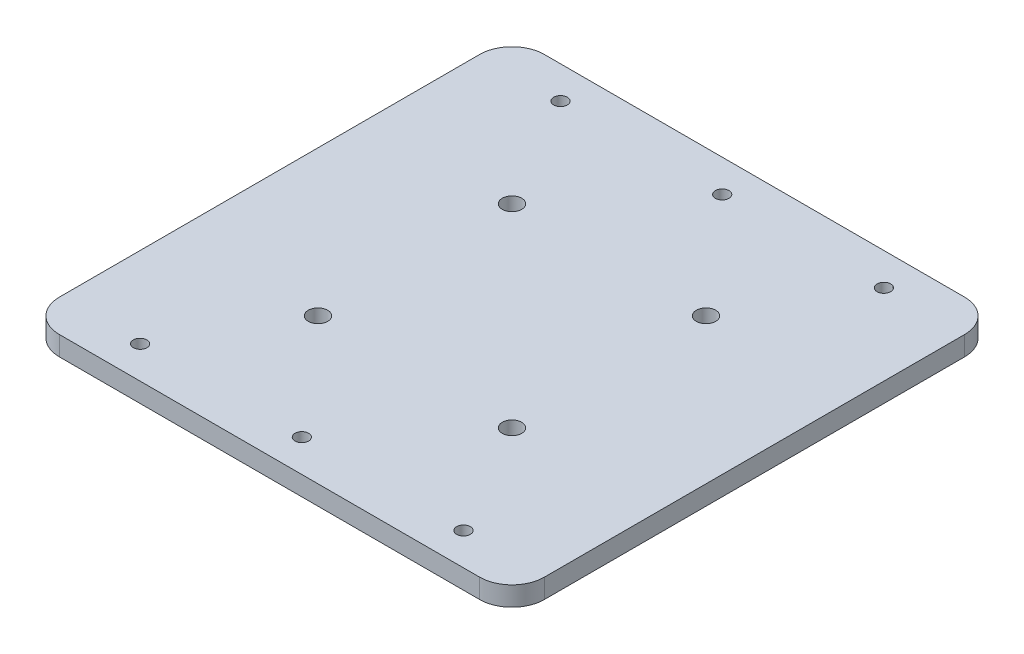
ISO-10303-21;
HEADER;
FILE_DESCRIPTION(('STEP AP214'),'2;1');
FILE_NAME('part.step','',(''),(''),'','','');
FILE_SCHEMA(('AUTOMOTIVE_DESIGN { 1 0 10303 214 1 1 1 1 }'));
ENDSEC;
DATA;
#1=APPLICATION_CONTEXT('core data for automotive mechanical design processes');
#2=APPLICATION_PROTOCOL_DEFINITION('international standard','automotive_design',2000,#1);
#3=PRODUCT_CONTEXT('',#1,'mechanical');
#4=PRODUCT('Part','Part','',(#3));
#5=PRODUCT_RELATED_PRODUCT_CATEGORY('part','',(#4));
#6=PRODUCT_DEFINITION_FORMATION('','',#4);
#7=PRODUCT_DEFINITION_CONTEXT('part definition',#1,'design');
#8=PRODUCT_DEFINITION('design','',#6,#7);
#9=PRODUCT_DEFINITION_SHAPE('','',#8);
#10=(LENGTH_UNIT() NAMED_UNIT(*) SI_UNIT(.MILLI.,.METRE.));
#11=(NAMED_UNIT(*) PLANE_ANGLE_UNIT() SI_UNIT($,.RADIAN.));
#12=(NAMED_UNIT(*) SI_UNIT($,.STERADIAN.) SOLID_ANGLE_UNIT());
#13=UNCERTAINTY_MEASURE_WITH_UNIT(LENGTH_MEASURE(1.E-05),#10,'distance_accuracy_value','');
#14=(GEOMETRIC_REPRESENTATION_CONTEXT(3) GLOBAL_UNCERTAINTY_ASSIGNED_CONTEXT((#13)) GLOBAL_UNIT_ASSIGNED_CONTEXT((#10,
#11,#12)) REPRESENTATION_CONTEXT('',''));
#15=CARTESIAN_POINT('',(0.,0.,0.));
#16=DIRECTION('',(0.,0.,1.));
#17=DIRECTION('',(1.,0.,0.));
#18=AXIS2_PLACEMENT_3D('',#15,#16,#17);
#19=CARTESIAN_POINT('',(75.,6.,75.));
#20=DIRECTION('',(-1.,0.,0.));
#21=DIRECTION('',(0.,0.,1.));
#22=AXIS2_PLACEMENT_3D('',#19,#20,#21);
#23=PLANE('',#22);
#24=DIRECTION('',(0.,0.,-1.));
#25=VECTOR('',#24,1.);
#26=CARTESIAN_POINT('',(75.,6.,75.));
#27=LINE('',#26,#25);
#28=CARTESIAN_POINT('',(75.,6.,65.));
#29=VERTEX_POINT('',#28);
#30=CARTESIAN_POINT('',(75.,6.,-65.));
#31=VERTEX_POINT('',#30);
#32=EDGE_CURVE('E400',#29,#31,#27,.T.);
#33=ORIENTED_EDGE('',*,*,#32,.F.);
#34=DIRECTION('',(0.,-1.,0.));
#35=VECTOR('',#34,1.);
#36=CARTESIAN_POINT('',(75.,6.,65.));
#37=LINE('',#36,#35);
#38=CARTESIAN_POINT('',(75.,0.,65.));
#39=VERTEX_POINT('',#38);
#40=EDGE_CURVE('E425',#29,#39,#37,.T.);
#41=ORIENTED_EDGE('',*,*,#40,.T.);
#42=DIRECTION('',(0.,0.,-1.));
#43=VECTOR('',#42,1.);
#44=CARTESIAN_POINT('',(75.,0.,75.));
#45=LINE('',#44,#43);
#46=CARTESIAN_POINT('',(75.,0.,-65.));
#47=VERTEX_POINT('',#46);
#48=EDGE_CURVE('E397',#39,#47,#45,.T.);
#49=ORIENTED_EDGE('',*,*,#48,.T.);
#50=DIRECTION('',(0.,-1.,0.));
#51=VECTOR('',#50,1.);
#52=CARTESIAN_POINT('',(75.,6.,-65.));
#53=LINE('',#52,#51);
#54=EDGE_CURVE('E413',#47,#31,#53,.F.);
#55=ORIENTED_EDGE('',*,*,#54,.T.);
#56=EDGE_LOOP('',(#33,#41,#49,#55));
#57=FACE_BOUND('',#56,.T.);
#58=ADVANCED_FACE('F36',(#57),#23,.F.);
#59=CARTESIAN_POINT('',(-75.,6.,-75.));
#60=DIRECTION('',(0.,0.,1.));
#61=DIRECTION('',(1.,0.,0.));
#62=AXIS2_PLACEMENT_3D('',#59,#60,#61);
#63=PLANE('',#62);
#64=DIRECTION('',(-1.,0.,0.));
#65=VECTOR('',#64,1.);
#66=CARTESIAN_POINT('',(-75.,0.,-75.));
#67=LINE('',#66,#65);
#68=CARTESIAN_POINT('',(65.,0.,-75.));
#69=VERTEX_POINT('',#68);
#70=CARTESIAN_POINT('',(-65.,0.,-75.));
#71=VERTEX_POINT('',#70);
#72=EDGE_CURVE('E416',#69,#71,#67,.T.);
#73=ORIENTED_EDGE('',*,*,#72,.T.);
#74=DIRECTION('',(0.,-1.,0.));
#75=VECTOR('',#74,1.);
#76=CARTESIAN_POINT('',(-65.,6.,-75.));
#77=LINE('',#76,#75);
#78=CARTESIAN_POINT('',(-65.,6.,-75.));
#79=VERTEX_POINT('',#78);
#80=EDGE_CURVE('E457',#71,#79,#77,.F.);
#81=ORIENTED_EDGE('',*,*,#80,.T.);
#82=DIRECTION('',(-1.,0.,0.));
#83=VECTOR('',#82,1.);
#84=CARTESIAN_POINT('',(-75.,6.,-75.));
#85=LINE('',#84,#83);
#86=CARTESIAN_POINT('',(65.,6.,-75.));
#87=VERTEX_POINT('',#86);
#88=EDGE_CURVE('E403',#87,#79,#85,.T.);
#89=ORIENTED_EDGE('',*,*,#88,.F.);
#90=DIRECTION('',(0.,-1.,0.));
#91=VECTOR('',#90,1.);
#92=CARTESIAN_POINT('',(65.,6.,-75.));
#93=LINE('',#92,#91);
#94=EDGE_CURVE('E454',#87,#69,#93,.T.);
#95=ORIENTED_EDGE('',*,*,#94,.T.);
#96=EDGE_LOOP('',(#73,#81,#89,#95));
#97=FACE_BOUND('',#96,.T.);
#98=ADVANCED_FACE('F648',(#97),#63,.F.);
#99=CARTESIAN_POINT('',(-75.,6.,75.));
#100=DIRECTION('',(1.,0.,0.));
#101=DIRECTION('',(0.,0.,-1.));
#102=AXIS2_PLACEMENT_3D('',#99,#100,#101);
#103=PLANE('',#102);
#104=DIRECTION('',(0.,0.,1.));
#105=VECTOR('',#104,1.);
#106=CARTESIAN_POINT('',(-75.,6.,75.));
#107=LINE('',#106,#105);
#108=CARTESIAN_POINT('',(-75.,6.,-65.));
#109=VERTEX_POINT('',#108);
#110=CARTESIAN_POINT('',(-75.,6.,65.));
#111=VERTEX_POINT('',#110);
#112=EDGE_CURVE('E407',#109,#111,#107,.T.);
#113=ORIENTED_EDGE('',*,*,#112,.F.);
#114=DIRECTION('',(0.,-1.,0.));
#115=VECTOR('',#114,1.);
#116=CARTESIAN_POINT('',(-75.,6.,-65.));
#117=LINE('',#116,#115);
#118=CARTESIAN_POINT('',(-75.,0.,-65.));
#119=VERTEX_POINT('',#118);
#120=EDGE_CURVE('E451',#109,#119,#117,.T.);
#121=ORIENTED_EDGE('',*,*,#120,.T.);
#122=DIRECTION('',(0.,0.,1.));
#123=VECTOR('',#122,1.);
#124=CARTESIAN_POINT('',(-75.,0.,75.));
#125=LINE('',#124,#123);
#126=CARTESIAN_POINT('',(-75.,0.,65.));
#127=VERTEX_POINT('',#126);
#128=EDGE_CURVE('E419',#119,#127,#125,.T.);
#129=ORIENTED_EDGE('',*,*,#128,.T.);
#130=DIRECTION('',(0.,-1.,0.));
#131=VECTOR('',#130,1.);
#132=CARTESIAN_POINT('',(-75.,6.,65.));
#133=LINE('',#132,#131);
#134=EDGE_CURVE('E449',#127,#111,#133,.F.);
#135=ORIENTED_EDGE('',*,*,#134,.T.);
#136=EDGE_LOOP('',(#113,#121,#129,#135));
#137=FACE_BOUND('',#136,.T.);
#138=ADVANCED_FACE('F654',(#137),#103,.F.);
#139=CARTESIAN_POINT('',(-75.,6.,75.));
#140=DIRECTION('',(0.,0.,-1.));
#141=DIRECTION('',(-1.,0.,0.));
#142=AXIS2_PLACEMENT_3D('',#139,#140,#141);
#143=PLANE('',#142);
#144=DIRECTION('',(1.,0.,0.));
#145=VECTOR('',#144,1.);
#146=CARTESIAN_POINT('',(-75.,0.,75.));
#147=LINE('',#146,#145);
#148=CARTESIAN_POINT('',(-65.,0.,75.));
#149=VERTEX_POINT('',#148);
#150=CARTESIAN_POINT('',(65.,0.,75.));
#151=VERTEX_POINT('',#150);
#152=EDGE_CURVE('E404',#149,#151,#147,.T.);
#153=ORIENTED_EDGE('',*,*,#152,.T.);
#154=DIRECTION('',(0.,-1.,0.));
#155=VECTOR('',#154,1.);
#156=CARTESIAN_POINT('',(65.,6.,75.));
#157=LINE('',#156,#155);
#158=CARTESIAN_POINT('',(65.,6.,75.));
#159=VERTEX_POINT('',#158);
#160=EDGE_CURVE('E439',#151,#159,#157,.F.);
#161=ORIENTED_EDGE('',*,*,#160,.T.);
#162=DIRECTION('',(1.,0.,0.));
#163=VECTOR('',#162,1.);
#164=CARTESIAN_POINT('',(-75.,6.,75.));
#165=LINE('',#164,#163);
#166=CARTESIAN_POINT('',(-65.,6.,75.));
#167=VERTEX_POINT('',#166);
#168=EDGE_CURVE('E410',#167,#159,#165,.T.);
#169=ORIENTED_EDGE('',*,*,#168,.F.);
#170=DIRECTION('',(0.,-1.,0.));
#171=VECTOR('',#170,1.);
#172=CARTESIAN_POINT('',(-65.,6.,75.));
#173=LINE('',#172,#171);
#174=EDGE_CURVE('E436',#167,#149,#173,.T.);
#175=ORIENTED_EDGE('',*,*,#174,.T.);
#176=EDGE_LOOP('',(#153,#161,#169,#175));
#177=FACE_BOUND('',#176,.T.);
#178=ADVANCED_FACE('F813',(#177),#143,.F.);
#179=CARTESIAN_POINT('',(0.,6.,0.));
#180=DIRECTION('',(0.,-1.,0.));
#181=DIRECTION('',(0.,0.,-1.));
#182=AXIS2_PLACEMENT_3D('',#179,#180,#181);
#183=PLANE('',#182);
#184=CARTESIAN_POINT('',(-50.,6.,64.9999999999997));
#185=DIRECTION('',(0.,1.,0.));
#186=DIRECTION('',(0.,0.,-1.));
#187=AXIS2_PLACEMENT_3D('',#184,#185,#186);
#188=CIRCLE('',#187,2.1);
#189=CARTESIAN_POINT('',(-50.,6.,62.8999999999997));
#190=VERTEX_POINT('',#189);
#191=EDGE_CURVE('E1493',#190,#190,#188,.T.);
#192=ORIENTED_EDGE('',*,*,#191,.F.);
#193=EDGE_LOOP('',(#192));
#194=FACE_BOUND('',#193,.T.);
#195=CARTESIAN_POINT('',(0.,6.,65.));
#196=DIRECTION('',(0.,1.,0.));
#197=DIRECTION('',(0.,0.,-1.));
#198=AXIS2_PLACEMENT_3D('',#195,#196,#197);
#199=CIRCLE('',#198,2.1);
#200=CARTESIAN_POINT('',(0.,6.,62.9));
#201=VERTEX_POINT('',#200);
#202=EDGE_CURVE('E1494',#201,#201,#199,.T.);
#203=ORIENTED_EDGE('',*,*,#202,.F.);
#204=EDGE_LOOP('',(#203));
#205=FACE_BOUND('',#204,.T.);
#206=CARTESIAN_POINT('',(50.,6.,65.));
#207=DIRECTION('',(0.,1.,0.));
#208=DIRECTION('',(0.,0.,-1.));
#209=AXIS2_PLACEMENT_3D('',#206,#207,#208);
#210=CIRCLE('',#209,2.1);
#211=CARTESIAN_POINT('',(50.,6.,62.9));
#212=VERTEX_POINT('',#211);
#213=EDGE_CURVE('E1496',#212,#212,#210,.T.);
#214=ORIENTED_EDGE('',*,*,#213,.F.);
#215=EDGE_LOOP('',(#214));
#216=FACE_BOUND('',#215,.T.);
#217=CARTESIAN_POINT('',(50.,6.,-65.));
#218=DIRECTION('',(0.,1.,0.));
#219=DIRECTION('',(0.,0.,1.));
#220=AXIS2_PLACEMENT_3D('',#217,#218,#219);
#221=CIRCLE('',#220,2.1);
#222=CARTESIAN_POINT('',(50.,6.,-62.9));
#223=VERTEX_POINT('',#222);
#224=EDGE_CURVE('E1501',#223,#223,#221,.T.);
#225=ORIENTED_EDGE('',*,*,#224,.F.);
#226=EDGE_LOOP('',(#225));
#227=FACE_BOUND('',#226,.T.);
#228=CARTESIAN_POINT('',(0.,6.,-65.));
#229=DIRECTION('',(0.,1.,0.));
#230=DIRECTION('',(0.,0.,1.));
#231=AXIS2_PLACEMENT_3D('',#228,#229,#230);
#232=CIRCLE('',#231,2.1);
#233=CARTESIAN_POINT('',(0.,6.,-62.9));
#234=VERTEX_POINT('',#233);
#235=EDGE_CURVE('E1504',#234,#234,#232,.T.);
#236=ORIENTED_EDGE('',*,*,#235,.F.);
#237=EDGE_LOOP('',(#236));
#238=FACE_BOUND('',#237,.T.);
#239=CARTESIAN_POINT('',(-50.,6.,-64.9999999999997));
#240=DIRECTION('',(0.,1.,0.));
#241=DIRECTION('',(0.,0.,1.));
#242=AXIS2_PLACEMENT_3D('',#239,#240,#241);
#243=CIRCLE('',#242,2.1);
#244=CARTESIAN_POINT('',(-50.,6.,-62.8999999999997));
#245=VERTEX_POINT('',#244);
#246=EDGE_CURVE('E277',#245,#245,#243,.T.);
#247=ORIENTED_EDGE('',*,*,#246,.F.);
#248=EDGE_LOOP('',(#247));
#249=FACE_BOUND('',#248,.T.);
#250=CARTESIAN_POINT('',(-30.,6.,30.));
#251=DIRECTION('',(0.,1.,0.));
#252=DIRECTION('',(0.,0.,1.));
#253=AXIS2_PLACEMENT_3D('',#250,#251,#252);
#254=CIRCLE('',#253,3.);
#255=CARTESIAN_POINT('',(-30.,6.,33.));
#256=VERTEX_POINT('',#255);
#257=EDGE_CURVE('E375',#256,#256,#254,.T.);
#258=ORIENTED_EDGE('',*,*,#257,.F.);
#259=EDGE_LOOP('',(#258));
#260=FACE_BOUND('',#259,.T.);
#261=CARTESIAN_POINT('',(30.,6.,30.));
#262=DIRECTION('',(0.,1.,0.));
#263=DIRECTION('',(0.,0.,1.));
#264=AXIS2_PLACEMENT_3D('',#261,#262,#263);
#265=CIRCLE('',#264,3.);
#266=CARTESIAN_POINT('',(30.,6.,33.));
#267=VERTEX_POINT('',#266);
#268=EDGE_CURVE('E386',#267,#267,#265,.T.);
#269=ORIENTED_EDGE('',*,*,#268,.F.);
#270=EDGE_LOOP('',(#269));
#271=FACE_BOUND('',#270,.T.);
#272=CARTESIAN_POINT('',(30.,6.,-30.));
#273=DIRECTION('',(0.,1.,0.));
#274=DIRECTION('',(0.,0.,1.));
#275=AXIS2_PLACEMENT_3D('',#272,#273,#274);
#276=CIRCLE('',#275,3.);
#277=CARTESIAN_POINT('',(30.,6.,-27.));
#278=VERTEX_POINT('',#277);
#279=EDGE_CURVE('E380',#278,#278,#276,.T.);
#280=ORIENTED_EDGE('',*,*,#279,.F.);
#281=EDGE_LOOP('',(#280));
#282=FACE_BOUND('',#281,.T.);
#283=CARTESIAN_POINT('',(-30.,6.,-30.));
#284=DIRECTION('',(0.,1.,0.));
#285=DIRECTION('',(0.,0.,1.));
#286=AXIS2_PLACEMENT_3D('',#283,#284,#285);
#287=CIRCLE('',#286,3.);
#288=CARTESIAN_POINT('',(-30.,6.,-27.));
#289=VERTEX_POINT('',#288);
#290=EDGE_CURVE('E379',#289,#289,#287,.T.);
#291=ORIENTED_EDGE('',*,*,#290,.F.);
#292=EDGE_LOOP('',(#291));
#293=FACE_BOUND('',#292,.T.);
#294=ORIENTED_EDGE('',*,*,#168,.T.);
#295=CARTESIAN_POINT('',(65.,6.,65.));
#296=DIRECTION('',(0.,-1.,0.));
#297=DIRECTION('',(0.,0.,-1.));
#298=AXIS2_PLACEMENT_3D('',#295,#296,#297);
#299=CIRCLE('',#298,10.);
#300=EDGE_CURVE('E447',#159,#29,#299,.F.);
#301=ORIENTED_EDGE('',*,*,#300,.T.);
#302=ORIENTED_EDGE('',*,*,#32,.T.);
#303=CARTESIAN_POINT('',(65.,6.,-65.));
#304=DIRECTION('',(0.,-1.,0.));
#305=DIRECTION('',(0.,0.,-1.));
#306=AXIS2_PLACEMENT_3D('',#303,#304,#305);
#307=CIRCLE('',#306,10.);
#308=EDGE_CURVE('E443',#31,#87,#307,.F.);
#309=ORIENTED_EDGE('',*,*,#308,.T.);
#310=ORIENTED_EDGE('',*,*,#88,.T.);
#311=CARTESIAN_POINT('',(-65.,6.,-65.));
#312=DIRECTION('',(0.,-1.,0.));
#313=DIRECTION('',(0.,0.,-1.));
#314=AXIS2_PLACEMENT_3D('',#311,#312,#313);
#315=CIRCLE('',#314,10.);
#316=EDGE_CURVE('E445',#79,#109,#315,.F.);
#317=ORIENTED_EDGE('',*,*,#316,.T.);
#318=ORIENTED_EDGE('',*,*,#112,.T.);
#319=CARTESIAN_POINT('',(-65.,6.,65.));
#320=DIRECTION('',(0.,-1.,0.));
#321=DIRECTION('',(0.,0.,-1.));
#322=AXIS2_PLACEMENT_3D('',#319,#320,#321);
#323=CIRCLE('',#322,10.);
#324=EDGE_CURVE('E441',#111,#167,#323,.F.);
#325=ORIENTED_EDGE('',*,*,#324,.T.);
#326=EDGE_LOOP('',(#294,#301,#302,#309,#310,#317,#318,#325));
#327=FACE_BOUND('',#326,.T.);
#328=ADVANCED_FACE('F810',(#194,#205,#216,#227,#238,#249,#260,#271,#282,#293,#327),#183,.F.);
#329=CARTESIAN_POINT('',(0.,0.,0.));
#330=DIRECTION('',(0.,-1.,0.));
#331=DIRECTION('',(0.,0.,-1.));
#332=AXIS2_PLACEMENT_3D('',#329,#330,#331);
#333=PLANE('',#332);
#334=CARTESIAN_POINT('',(-50.,0.,64.9999999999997));
#335=DIRECTION('',(0.,-1.,0.));
#336=DIRECTION('',(0.,0.,-1.));
#337=AXIS2_PLACEMENT_3D('',#334,#335,#336);
#338=CIRCLE('',#337,6.00000000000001);
#339=CARTESIAN_POINT('',(-50.,0.,58.9999999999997));
#340=VERTEX_POINT('',#339);
#341=EDGE_CURVE('E516',#340,#340,#338,.F.);
#342=ORIENTED_EDGE('',*,*,#341,.T.);
#343=EDGE_LOOP('',(#342));
#344=FACE_BOUND('',#343,.T.);
#345=CARTESIAN_POINT('',(50.,0.,65.));
#346=DIRECTION('',(0.,-1.,0.));
#347=DIRECTION('',(0.,0.,-1.));
#348=AXIS2_PLACEMENT_3D('',#345,#346,#347);
#349=CIRCLE('',#348,6.00000000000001);
#350=CARTESIAN_POINT('',(50.,0.,59.));
#351=VERTEX_POINT('',#350);
#352=EDGE_CURVE('E513',#351,#351,#349,.F.);
#353=ORIENTED_EDGE('',*,*,#352,.T.);
#354=EDGE_LOOP('',(#353));
#355=FACE_BOUND('',#354,.T.);
#356=CARTESIAN_POINT('',(0.,0.,65.));
#357=DIRECTION('',(0.,-1.,0.));
#358=DIRECTION('',(0.,0.,-1.));
#359=AXIS2_PLACEMENT_3D('',#356,#357,#358);
#360=CIRCLE('',#359,6.);
#361=CARTESIAN_POINT('',(0.,0.,59.));
#362=VERTEX_POINT('',#361);
#363=EDGE_CURVE('E510',#362,#362,#360,.F.);
#364=ORIENTED_EDGE('',*,*,#363,.T.);
#365=EDGE_LOOP('',(#364));
#366=FACE_BOUND('',#365,.T.);
#367=CARTESIAN_POINT('',(50.,0.,-65.));
#368=DIRECTION('',(0.,-1.,0.));
#369=DIRECTION('',(0.,0.,-1.));
#370=AXIS2_PLACEMENT_3D('',#367,#368,#369);
#371=CIRCLE('',#370,6.00000000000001);
#372=CARTESIAN_POINT('',(50.,0.,-71.));
#373=VERTEX_POINT('',#372);
#374=EDGE_CURVE('E507',#373,#373,#371,.F.);
#375=ORIENTED_EDGE('',*,*,#374,.T.);
#376=EDGE_LOOP('',(#375));
#377=FACE_BOUND('',#376,.T.);
#378=CARTESIAN_POINT('',(0.,0.,-65.));
#379=DIRECTION('',(0.,-1.,0.));
#380=DIRECTION('',(0.,0.,-1.));
#381=AXIS2_PLACEMENT_3D('',#378,#379,#380);
#382=CIRCLE('',#381,6.);
#383=CARTESIAN_POINT('',(0.,0.,-71.));
#384=VERTEX_POINT('',#383);
#385=EDGE_CURVE('E504',#384,#384,#382,.F.);
#386=ORIENTED_EDGE('',*,*,#385,.T.);
#387=EDGE_LOOP('',(#386));
#388=FACE_BOUND('',#387,.T.);
#389=CARTESIAN_POINT('',(-50.,0.,-64.9999999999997));
#390=DIRECTION('',(0.,-1.,0.));
#391=DIRECTION('',(0.,0.,-1.));
#392=AXIS2_PLACEMENT_3D('',#389,#390,#391);
#393=CIRCLE('',#392,6.00000000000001);
#394=CARTESIAN_POINT('',(-50.,0.,-70.9999999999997));
#395=VERTEX_POINT('',#394);
#396=EDGE_CURVE('E501',#395,#395,#393,.F.);
#397=ORIENTED_EDGE('',*,*,#396,.T.);
#398=EDGE_LOOP('',(#397));
#399=FACE_BOUND('',#398,.T.);
#400=DIRECTION('',(-1.,0.,0.));
#401=VECTOR('',#400,1.);
#402=CARTESIAN_POINT('',(20.,0.,-33.));
#403=LINE('',#402,#401);
#404=CARTESIAN_POINT('',(-20.,0.,-33.));
#405=VERTEX_POINT('',#404);
#406=CARTESIAN_POINT('',(20.,0.,-33.));
#407=VERTEX_POINT('',#406);
#408=EDGE_CURVE('E492',#405,#407,#403,.F.);
#409=ORIENTED_EDGE('',*,*,#408,.T.);
#410=CARTESIAN_POINT('',(20.,0.,-45.));
#411=DIRECTION('',(0.,-1.,0.));
#412=DIRECTION('',(0.,0.,-1.));
#413=AXIS2_PLACEMENT_3D('',#410,#411,#412);
#414=CIRCLE('',#413,12.);
#415=CARTESIAN_POINT('',(20.,0.,-57.));
#416=VERTEX_POINT('',#415);
#417=EDGE_CURVE('E498',#407,#416,#414,.F.);
#418=ORIENTED_EDGE('',*,*,#417,.T.);
#419=DIRECTION('',(1.,0.,0.));
#420=VECTOR('',#419,1.);
#421=CARTESIAN_POINT('',(-20.,0.,-57.));
#422=LINE('',#421,#420);
#423=CARTESIAN_POINT('',(-20.,0.,-57.));
#424=VERTEX_POINT('',#423);
#425=EDGE_CURVE('E496',#416,#424,#422,.F.);
#426=ORIENTED_EDGE('',*,*,#425,.T.);
#427=CARTESIAN_POINT('',(-20.,0.,-45.));
#428=DIRECTION('',(0.,-1.,0.));
#429=DIRECTION('',(0.,0.,-1.));
#430=AXIS2_PLACEMENT_3D('',#427,#428,#429);
#431=CIRCLE('',#430,12.);
#432=EDGE_CURVE('E494',#424,#405,#431,.F.);
#433=ORIENTED_EDGE('',*,*,#432,.T.);
#434=EDGE_LOOP('',(#409,#418,#426,#433));
#435=FACE_BOUND('',#434,.T.);
#436=DIRECTION('',(0.,0.,-1.));
#437=VECTOR('',#436,1.);
#438=CARTESIAN_POINT('',(43.,0.,30.));
#439=LINE('',#438,#437);
#440=CARTESIAN_POINT('',(43.,0.,-30.));
#441=VERTEX_POINT('',#440);
#442=CARTESIAN_POINT('',(43.,0.,30.));
#443=VERTEX_POINT('',#442);
#444=EDGE_CURVE('E483',#441,#443,#439,.F.);
#445=ORIENTED_EDGE('',*,*,#444,.T.);
#446=CARTESIAN_POINT('',(55.,0.,30.));
#447=DIRECTION('',(0.,-1.,0.));
#448=DIRECTION('',(0.,0.,-1.));
#449=AXIS2_PLACEMENT_3D('',#446,#447,#448);
#450=CIRCLE('',#449,12.);
#451=CARTESIAN_POINT('',(67.,0.,30.));
#452=VERTEX_POINT('',#451);
#453=EDGE_CURVE('E489',#443,#452,#450,.F.);
#454=ORIENTED_EDGE('',*,*,#453,.T.);
#455=DIRECTION('',(0.,0.,1.));
#456=VECTOR('',#455,1.);
#457=CARTESIAN_POINT('',(67.,0.,-30.));
#458=LINE('',#457,#456);
#459=CARTESIAN_POINT('',(67.,0.,-30.));
#460=VERTEX_POINT('',#459);
#461=EDGE_CURVE('E487',#452,#460,#458,.F.);
#462=ORIENTED_EDGE('',*,*,#461,.T.);
#463=CARTESIAN_POINT('',(55.,0.,-30.));
#464=DIRECTION('',(0.,-1.,0.));
#465=DIRECTION('',(0.,0.,-1.));
#466=AXIS2_PLACEMENT_3D('',#463,#464,#465);
#467=CIRCLE('',#466,12.);
#468=EDGE_CURVE('E485',#460,#441,#467,.F.);
#469=ORIENTED_EDGE('',*,*,#468,.T.);
#470=EDGE_LOOP('',(#445,#454,#462,#469));
#471=FACE_BOUND('',#470,.T.);
#472=CARTESIAN_POINT('',(0.,0.,0.));
#473=DIRECTION('',(0.,-1.,0.));
#474=DIRECTION('',(0.,0.,-1.));
#475=AXIS2_PLACEMENT_3D('',#472,#473,#474);
#476=CIRCLE('',#475,27.);
#477=CARTESIAN_POINT('',(0.,0.,-27.));
#478=VERTEX_POINT('',#477);
#479=EDGE_CURVE('E480',#478,#478,#476,.F.);
#480=ORIENTED_EDGE('',*,*,#479,.T.);
#481=EDGE_LOOP('',(#480));
#482=FACE_BOUND('',#481,.T.);
#483=CARTESIAN_POINT('',(-20.,0.,45.));
#484=DIRECTION('',(0.,-1.,0.));
#485=DIRECTION('',(0.,0.,-1.));
#486=AXIS2_PLACEMENT_3D('',#483,#484,#485);
#487=CIRCLE('',#486,12.);
#488=CARTESIAN_POINT('',(-20.,0.,33.));
#489=VERTEX_POINT('',#488);
#490=CARTESIAN_POINT('',(-20.,0.,57.));
#491=VERTEX_POINT('',#490);
#492=EDGE_CURVE('E471',#489,#491,#487,.F.);
#493=ORIENTED_EDGE('',*,*,#492,.T.);
#494=DIRECTION('',(-1.,0.,0.));
#495=VECTOR('',#494,1.);
#496=CARTESIAN_POINT('',(20.,0.,57.));
#497=LINE('',#496,#495);
#498=CARTESIAN_POINT('',(20.,0.,57.));
#499=VERTEX_POINT('',#498);
#500=EDGE_CURVE('E477',#491,#499,#497,.F.);
#501=ORIENTED_EDGE('',*,*,#500,.T.);
#502=CARTESIAN_POINT('',(20.,0.,45.));
#503=DIRECTION('',(0.,-1.,0.));
#504=DIRECTION('',(0.,0.,-1.));
#505=AXIS2_PLACEMENT_3D('',#502,#503,#504);
#506=CIRCLE('',#505,12.);
#507=CARTESIAN_POINT('',(20.,0.,33.));
#508=VERTEX_POINT('',#507);
#509=EDGE_CURVE('E475',#499,#508,#506,.F.);
#510=ORIENTED_EDGE('',*,*,#509,.T.);
#511=DIRECTION('',(1.,0.,0.));
#512=VECTOR('',#511,1.);
#513=CARTESIAN_POINT('',(-20.,0.,33.));
#514=LINE('',#513,#512);
#515=EDGE_CURVE('E473',#508,#489,#514,.F.);
#516=ORIENTED_EDGE('',*,*,#515,.T.);
#517=EDGE_LOOP('',(#493,#501,#510,#516));
#518=FACE_BOUND('',#517,.T.);
#519=CARTESIAN_POINT('',(-55.,0.,30.));
#520=DIRECTION('',(0.,-1.,0.));
#521=DIRECTION('',(0.,0.,-1.));
#522=AXIS2_PLACEMENT_3D('',#519,#520,#521);
#523=CIRCLE('',#522,12.);
#524=CARTESIAN_POINT('',(-67.,0.,30.));
#525=VERTEX_POINT('',#524);
#526=CARTESIAN_POINT('',(-43.,0.,30.));
#527=VERTEX_POINT('',#526);
#528=EDGE_CURVE('E462',#525,#527,#523,.F.);
#529=ORIENTED_EDGE('',*,*,#528,.T.);
#530=DIRECTION('',(0.,0.,1.));
#531=VECTOR('',#530,1.);
#532=CARTESIAN_POINT('',(-43.,0.,-30.));
#533=LINE('',#532,#531);
#534=CARTESIAN_POINT('',(-43.,0.,-30.));
#535=VERTEX_POINT('',#534);
#536=EDGE_CURVE('E468',#527,#535,#533,.F.);
#537=ORIENTED_EDGE('',*,*,#536,.T.);
#538=CARTESIAN_POINT('',(-55.,0.,-30.));
#539=DIRECTION('',(0.,-1.,0.));
#540=DIRECTION('',(0.,0.,-1.));
#541=AXIS2_PLACEMENT_3D('',#538,#539,#540);
#542=CIRCLE('',#541,12.);
#543=CARTESIAN_POINT('',(-67.,0.,-30.));
#544=VERTEX_POINT('',#543);
#545=EDGE_CURVE('E466',#535,#544,#542,.F.);
#546=ORIENTED_EDGE('',*,*,#545,.T.);
#547=DIRECTION('',(0.,0.,-1.));
#548=VECTOR('',#547,1.);
#549=CARTESIAN_POINT('',(-67.,0.,30.));
#550=LINE('',#549,#548);
#551=EDGE_CURVE('E464',#544,#525,#550,.F.);
#552=ORIENTED_EDGE('',*,*,#551,.T.);
#553=EDGE_LOOP('',(#529,#537,#546,#552));
#554=FACE_BOUND('',#553,.T.);
#555=CARTESIAN_POINT('',(-30.,0.,30.));
#556=DIRECTION('',(0.,1.,0.));
#557=DIRECTION('',(0.,0.,1.));
#558=AXIS2_PLACEMENT_3D('',#555,#556,#557);
#559=CIRCLE('',#558,3.);
#560=CARTESIAN_POINT('',(-30.,0.,33.));
#561=VERTEX_POINT('',#560);
#562=EDGE_CURVE('E389',#561,#561,#559,.T.);
#563=ORIENTED_EDGE('',*,*,#562,.T.);
#564=EDGE_LOOP('',(#563));
#565=FACE_BOUND('',#564,.T.);
#566=CARTESIAN_POINT('',(30.,0.,30.));
#567=DIRECTION('',(0.,1.,0.));
#568=DIRECTION('',(0.,0.,1.));
#569=AXIS2_PLACEMENT_3D('',#566,#567,#568);
#570=CIRCLE('',#569,3.);
#571=CARTESIAN_POINT('',(30.,0.,33.));
#572=VERTEX_POINT('',#571);
#573=EDGE_CURVE('E383',#572,#572,#570,.T.);
#574=ORIENTED_EDGE('',*,*,#573,.T.);
#575=EDGE_LOOP('',(#574));
#576=FACE_BOUND('',#575,.T.);
#577=CARTESIAN_POINT('',(30.,0.,-30.));
#578=DIRECTION('',(0.,1.,0.));
#579=DIRECTION('',(0.,0.,1.));
#580=AXIS2_PLACEMENT_3D('',#577,#578,#579);
#581=CIRCLE('',#580,3.);
#582=CARTESIAN_POINT('',(30.,0.,-27.));
#583=VERTEX_POINT('',#582);
#584=EDGE_CURVE('E376',#583,#583,#581,.T.);
#585=ORIENTED_EDGE('',*,*,#584,.T.);
#586=EDGE_LOOP('',(#585));
#587=FACE_BOUND('',#586,.T.);
#588=CARTESIAN_POINT('',(-30.,0.,-30.));
#589=DIRECTION('',(0.,1.,0.));
#590=DIRECTION('',(0.,0.,1.));
#591=AXIS2_PLACEMENT_3D('',#588,#589,#590);
#592=CIRCLE('',#591,3.);
#593=CARTESIAN_POINT('',(-30.,0.,-27.));
#594=VERTEX_POINT('',#593);
#595=EDGE_CURVE('E394',#594,#594,#592,.T.);
#596=ORIENTED_EDGE('',*,*,#595,.T.);
#597=EDGE_LOOP('',(#596));
#598=FACE_BOUND('',#597,.T.);
#599=ORIENTED_EDGE('',*,*,#48,.F.);
#600=CARTESIAN_POINT('',(65.,0.,65.));
#601=DIRECTION('',(0.,-1.,0.));
#602=DIRECTION('',(0.,0.,-1.));
#603=AXIS2_PLACEMENT_3D('',#600,#601,#602);
#604=CIRCLE('',#603,10.);
#605=EDGE_CURVE('E434',#39,#151,#604,.T.);
#606=ORIENTED_EDGE('',*,*,#605,.T.);
#607=ORIENTED_EDGE('',*,*,#152,.F.);
#608=CARTESIAN_POINT('',(-65.,0.,65.));
#609=DIRECTION('',(0.,-1.,0.));
#610=DIRECTION('',(0.,0.,-1.));
#611=AXIS2_PLACEMENT_3D('',#608,#609,#610);
#612=CIRCLE('',#611,10.);
#613=EDGE_CURVE('E428',#149,#127,#612,.T.);
#614=ORIENTED_EDGE('',*,*,#613,.T.);
#615=ORIENTED_EDGE('',*,*,#128,.F.);
#616=CARTESIAN_POINT('',(-65.,0.,-65.));
#617=DIRECTION('',(0.,-1.,0.));
#618=DIRECTION('',(0.,0.,-1.));
#619=AXIS2_PLACEMENT_3D('',#616,#617,#618);
#620=CIRCLE('',#619,10.);
#621=EDGE_CURVE('E432',#119,#71,#620,.T.);
#622=ORIENTED_EDGE('',*,*,#621,.T.);
#623=ORIENTED_EDGE('',*,*,#72,.F.);
#624=CARTESIAN_POINT('',(65.,0.,-65.));
#625=DIRECTION('',(0.,-1.,0.));
#626=DIRECTION('',(0.,0.,-1.));
#627=AXIS2_PLACEMENT_3D('',#624,#625,#626);
#628=CIRCLE('',#627,10.);
#629=EDGE_CURVE('E430',#69,#47,#628,.T.);
#630=ORIENTED_EDGE('',*,*,#629,.T.);
#631=EDGE_LOOP('',(#599,#606,#607,#614,#615,#622,#623,#630));
#632=FACE_BOUND('',#631,.T.);
#633=ADVANCED_FACE('F808',(#344,#355,#366,#377,#388,#399,#435,#471,#482,#518,#554,#565,#576,
#587,#598,#632),#333,.T.);
#634=CARTESIAN_POINT('',(-30.,0.,-30.));
#635=DIRECTION('',(0.,1.,0.));
#636=DIRECTION('',(0.,0.,1.));
#637=AXIS2_PLACEMENT_3D('',#634,#635,#636);
#638=CYLINDRICAL_SURFACE('',#637,3.);
#639=ORIENTED_EDGE('',*,*,#595,.F.);
#640=EDGE_LOOP('',(#639));
#641=FACE_BOUND('',#640,.T.);
#642=ORIENTED_EDGE('',*,*,#290,.T.);
#643=EDGE_LOOP('',(#642));
#644=FACE_BOUND('',#643,.T.);
#645=ADVANCED_FACE('F798',(#641,#644),#638,.F.);
#646=CARTESIAN_POINT('',(30.,0.,-30.));
#647=DIRECTION('',(0.,1.,0.));
#648=DIRECTION('',(0.,0.,1.));
#649=AXIS2_PLACEMENT_3D('',#646,#647,#648);
#650=CYLINDRICAL_SURFACE('',#649,3.);
#651=ORIENTED_EDGE('',*,*,#584,.F.);
#652=EDGE_LOOP('',(#651));
#653=FACE_BOUND('',#652,.T.);
#654=ORIENTED_EDGE('',*,*,#279,.T.);
#655=EDGE_LOOP('',(#654));
#656=FACE_BOUND('',#655,.T.);
#657=ADVANCED_FACE('F794',(#653,#656),#650,.F.);
#658=CARTESIAN_POINT('',(30.,0.,30.));
#659=DIRECTION('',(0.,1.,0.));
#660=DIRECTION('',(0.,0.,1.));
#661=AXIS2_PLACEMENT_3D('',#658,#659,#660);
#662=CYLINDRICAL_SURFACE('',#661,3.);
#663=ORIENTED_EDGE('',*,*,#573,.F.);
#664=EDGE_LOOP('',(#663));
#665=FACE_BOUND('',#664,.T.);
#666=ORIENTED_EDGE('',*,*,#268,.T.);
#667=EDGE_LOOP('',(#666));
#668=FACE_BOUND('',#667,.T.);
#669=ADVANCED_FACE('F797',(#665,#668),#662,.F.);
#670=CARTESIAN_POINT('',(-30.,0.,30.));
#671=DIRECTION('',(0.,1.,0.));
#672=DIRECTION('',(0.,0.,1.));
#673=AXIS2_PLACEMENT_3D('',#670,#671,#672);
#674=CYLINDRICAL_SURFACE('',#673,3.);
#675=ORIENTED_EDGE('',*,*,#562,.F.);
#676=EDGE_LOOP('',(#675));
#677=FACE_BOUND('',#676,.T.);
#678=ORIENTED_EDGE('',*,*,#257,.T.);
#679=EDGE_LOOP('',(#678));
#680=FACE_BOUND('',#679,.T.);
#681=ADVANCED_FACE('F632',(#677,#680),#674,.F.);
#682=CARTESIAN_POINT('',(50.,3.,65.));
#683=DIRECTION('',(0.,-1.,0.));
#684=DIRECTION('',(0.,0.,-1.));
#685=AXIS2_PLACEMENT_3D('',#682,#683,#684);
#686=PLANE('',#685);
#687=CARTESIAN_POINT('',(50.,3.,65.));
#688=DIRECTION('',(0.,-1.,0.));
#689=DIRECTION('',(0.,0.,-1.));
#690=AXIS2_PLACEMENT_3D('',#687,#688,#689);
#691=CIRCLE('',#690,2.1);
#692=CARTESIAN_POINT('',(50.,3.,62.9));
#693=VERTEX_POINT('',#692);
#694=EDGE_CURVE('E40',#693,#693,#691,.T.);
#695=ORIENTED_EDGE('',*,*,#694,.F.);
#696=EDGE_LOOP('',(#695));
#697=FACE_BOUND('',#696,.T.);
#698=CARTESIAN_POINT('',(50.,3.,65.));
#699=DIRECTION('',(0.,-1.,0.));
#700=DIRECTION('',(0.,0.,-1.));
#701=AXIS2_PLACEMENT_3D('',#698,#699,#700);
#702=CIRCLE('',#701,4.00000000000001);
#703=CARTESIAN_POINT('',(50.,3.,61.));
#704=VERTEX_POINT('',#703);
#705=EDGE_CURVE('E362',#704,#704,#702,.T.);
#706=ORIENTED_EDGE('',*,*,#705,.T.);
#707=EDGE_LOOP('',(#706));
#708=FACE_BOUND('',#707,.T.);
#709=ADVANCED_FACE('F628',(#697,#708),#686,.T.);
#710=CARTESIAN_POINT('',(50.,3.,65.));
#711=DIRECTION('',(0.,-1.,0.));
#712=DIRECTION('',(0.,0.,-1.));
#713=AXIS2_PLACEMENT_3D('',#710,#711,#712);
#714=CYLINDRICAL_SURFACE('',#713,4.00000000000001);
#715=CARTESIAN_POINT('',(50.,2.,65.));
#716=DIRECTION('',(0.,-1.,0.));
#717=DIRECTION('',(0.,0.,-1.));
#718=AXIS2_PLACEMENT_3D('',#715,#716,#717);
#719=CIRCLE('',#718,4.00000000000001);
#720=CARTESIAN_POINT('',(50.,2.,61.));
#721=VERTEX_POINT('',#720);
#722=EDGE_CURVE('E545',#721,#721,#719,.T.);
#723=ORIENTED_EDGE('',*,*,#722,.T.);
#724=EDGE_LOOP('',(#723));
#725=FACE_BOUND('',#724,.T.);
#726=ORIENTED_EDGE('',*,*,#705,.F.);
#727=EDGE_LOOP('',(#726));
#728=FACE_BOUND('',#727,.T.);
#729=ADVANCED_FACE('F631',(#725,#728),#714,.F.);
#730=CARTESIAN_POINT('',(-50.,3.,64.9999999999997));
#731=DIRECTION('',(0.,-1.,0.));
#732=DIRECTION('',(0.,0.,-1.));
#733=AXIS2_PLACEMENT_3D('',#730,#731,#732);
#734=PLANE('',#733);
#735=CARTESIAN_POINT('',(-50.,3.,64.9999999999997));
#736=DIRECTION('',(0.,-1.,0.));
#737=DIRECTION('',(0.,0.,-1.));
#738=AXIS2_PLACEMENT_3D('',#735,#736,#737);
#739=CIRCLE('',#738,2.1);
#740=CARTESIAN_POINT('',(-50.,3.,62.8999999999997));
#741=VERTEX_POINT('',#740);
#742=EDGE_CURVE('E618',#741,#741,#739,.T.);
#743=ORIENTED_EDGE('',*,*,#742,.F.);
#744=EDGE_LOOP('',(#743));
#745=FACE_BOUND('',#744,.T.);
#746=CARTESIAN_POINT('',(-50.,3.,64.9999999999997));
#747=DIRECTION('',(0.,-1.,0.));
#748=DIRECTION('',(0.,0.,-1.));
#749=AXIS2_PLACEMENT_3D('',#746,#747,#748);
#750=CIRCLE('',#749,4.00000000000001);
#751=CARTESIAN_POINT('',(-50.,3.,60.9999999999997));
#752=VERTEX_POINT('',#751);
#753=EDGE_CURVE('E361',#752,#752,#750,.T.);
#754=ORIENTED_EDGE('',*,*,#753,.T.);
#755=EDGE_LOOP('',(#754));
#756=FACE_BOUND('',#755,.T.);
#757=ADVANCED_FACE('F637',(#745,#756),#734,.T.);
#758=CARTESIAN_POINT('',(-50.,3.,64.9999999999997));
#759=DIRECTION('',(0.,-1.,0.));
#760=DIRECTION('',(0.,0.,-1.));
#761=AXIS2_PLACEMENT_3D('',#758,#759,#760);
#762=CYLINDRICAL_SURFACE('',#761,4.00000000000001);
#763=CARTESIAN_POINT('',(-50.,2.,64.9999999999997));
#764=DIRECTION('',(0.,-1.,0.));
#765=DIRECTION('',(0.,0.,-1.));
#766=AXIS2_PLACEMENT_3D('',#763,#764,#765);
#767=CIRCLE('',#766,4.00000000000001);
#768=CARTESIAN_POINT('',(-50.,2.,60.9999999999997));
#769=VERTEX_POINT('',#768);
#770=EDGE_CURVE('E542',#769,#769,#767,.T.);
#771=ORIENTED_EDGE('',*,*,#770,.T.);
#772=EDGE_LOOP('',(#771));
#773=FACE_BOUND('',#772,.T.);
#774=ORIENTED_EDGE('',*,*,#753,.F.);
#775=EDGE_LOOP('',(#774));
#776=FACE_BOUND('',#775,.T.);
#777=ADVANCED_FACE('F643',(#773,#776),#762,.F.);
#778=CARTESIAN_POINT('',(-50.,3.,-64.9999999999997));
#779=DIRECTION('',(0.,1.,0.));
#780=DIRECTION('',(0.,0.,1.));
#781=AXIS2_PLACEMENT_3D('',#778,#779,#780);
#782=PLANE('',#781);
#783=CARTESIAN_POINT('',(-50.,3.,-64.9999999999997));
#784=DIRECTION('',(0.,1.,0.));
#785=DIRECTION('',(0.,0.,1.));
#786=AXIS2_PLACEMENT_3D('',#783,#784,#785);
#787=CIRCLE('',#786,2.1);
#788=CARTESIAN_POINT('',(-50.,3.,-62.8999999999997));
#789=VERTEX_POINT('',#788);
#790=EDGE_CURVE('E616',#789,#789,#787,.T.);
#791=ORIENTED_EDGE('',*,*,#790,.T.);
#792=EDGE_LOOP('',(#791));
#793=FACE_BOUND('',#792,.T.);
#794=CARTESIAN_POINT('',(-50.,3.,-64.9999999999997));
#795=DIRECTION('',(0.,-1.,0.));
#796=DIRECTION('',(0.,0.,1.));
#797=AXIS2_PLACEMENT_3D('',#794,#795,#796);
#798=CIRCLE('',#797,4.00000000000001);
#799=CARTESIAN_POINT('',(-50.,3.,-60.9999999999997));
#800=VERTEX_POINT('',#799);
#801=EDGE_CURVE('E357',#800,#800,#798,.T.);
#802=ORIENTED_EDGE('',*,*,#801,.T.);
#803=EDGE_LOOP('',(#802));
#804=FACE_BOUND('',#803,.T.);
#805=ADVANCED_FACE('F778',(#793,#804),#782,.F.);
#806=CARTESIAN_POINT('',(-50.,3.,-64.9999999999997));
#807=DIRECTION('',(0.,-1.,0.));
#808=DIRECTION('',(0.,0.,-1.));
#809=AXIS2_PLACEMENT_3D('',#806,#807,#808);
#810=CYLINDRICAL_SURFACE('',#809,4.00000000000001);
#811=CARTESIAN_POINT('',(-50.,2.,-64.9999999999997));
#812=DIRECTION('',(0.,-1.,0.));
#813=DIRECTION('',(0.,0.,-1.));
#814=AXIS2_PLACEMENT_3D('',#811,#812,#813);
#815=CIRCLE('',#814,4.00000000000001);
#816=CARTESIAN_POINT('',(-50.,2.,-68.9999999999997));
#817=VERTEX_POINT('',#816);
#818=EDGE_CURVE('E557',#817,#817,#815,.T.);
#819=ORIENTED_EDGE('',*,*,#818,.T.);
#820=EDGE_LOOP('',(#819));
#821=FACE_BOUND('',#820,.T.);
#822=ORIENTED_EDGE('',*,*,#801,.F.);
#823=EDGE_LOOP('',(#822));
#824=FACE_BOUND('',#823,.T.);
#825=ADVANCED_FACE('F774',(#821,#824),#810,.F.);
#826=CARTESIAN_POINT('',(50.,3.,-65.));
#827=DIRECTION('',(0.,1.,0.));
#828=DIRECTION('',(0.,0.,1.));
#829=AXIS2_PLACEMENT_3D('',#826,#827,#828);
#830=PLANE('',#829);
#831=CARTESIAN_POINT('',(50.,3.,-65.));
#832=DIRECTION('',(0.,1.,0.));
#833=DIRECTION('',(0.,0.,1.));
#834=AXIS2_PLACEMENT_3D('',#831,#832,#833);
#835=CIRCLE('',#834,2.1);
#836=CARTESIAN_POINT('',(50.,3.,-62.9));
#837=VERTEX_POINT('',#836);
#838=EDGE_CURVE('E613',#837,#837,#835,.T.);
#839=ORIENTED_EDGE('',*,*,#838,.T.);
#840=EDGE_LOOP('',(#839));
#841=FACE_BOUND('',#840,.T.);
#842=CARTESIAN_POINT('',(50.,3.,-65.));
#843=DIRECTION('',(0.,-1.,0.));
#844=DIRECTION('',(0.,0.,1.));
#845=AXIS2_PLACEMENT_3D('',#842,#843,#844);
#846=CIRCLE('',#845,4.00000000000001);
#847=CARTESIAN_POINT('',(50.,3.,-61.));
#848=VERTEX_POINT('',#847);
#849=EDGE_CURVE('E365',#848,#848,#846,.T.);
#850=ORIENTED_EDGE('',*,*,#849,.T.);
#851=EDGE_LOOP('',(#850));
#852=FACE_BOUND('',#851,.T.);
#853=ADVANCED_FACE('F777',(#841,#852),#830,.F.);
#854=CARTESIAN_POINT('',(50.,3.,-65.));
#855=DIRECTION('',(0.,-1.,0.));
#856=DIRECTION('',(0.,0.,-1.));
#857=AXIS2_PLACEMENT_3D('',#854,#855,#856);
#858=CYLINDRICAL_SURFACE('',#857,4.00000000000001);
#859=CARTESIAN_POINT('',(50.,2.,-65.));
#860=DIRECTION('',(0.,-1.,0.));
#861=DIRECTION('',(0.,0.,-1.));
#862=AXIS2_PLACEMENT_3D('',#859,#860,#861);
#863=CIRCLE('',#862,4.00000000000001);
#864=CARTESIAN_POINT('',(50.,2.,-69.));
#865=VERTEX_POINT('',#864);
#866=EDGE_CURVE('E551',#865,#865,#863,.T.);
#867=ORIENTED_EDGE('',*,*,#866,.T.);
#868=EDGE_LOOP('',(#867));
#869=FACE_BOUND('',#868,.T.);
#870=ORIENTED_EDGE('',*,*,#849,.F.);
#871=EDGE_LOOP('',(#870));
#872=FACE_BOUND('',#871,.T.);
#873=ADVANCED_FACE('F904',(#869,#872),#858,.F.);
#874=CARTESIAN_POINT('',(0.,3.,-65.));
#875=DIRECTION('',(0.,1.,0.));
#876=DIRECTION('',(0.,0.,1.));
#877=AXIS2_PLACEMENT_3D('',#874,#875,#876);
#878=PLANE('',#877);
#879=CARTESIAN_POINT('',(0.,3.,-65.));
#880=DIRECTION('',(0.,1.,0.));
#881=DIRECTION('',(0.,0.,1.));
#882=AXIS2_PLACEMENT_3D('',#879,#880,#881);
#883=CIRCLE('',#882,2.1);
#884=CARTESIAN_POINT('',(0.,3.,-62.9));
#885=VERTEX_POINT('',#884);
#886=EDGE_CURVE('E610',#885,#885,#883,.T.);
#887=ORIENTED_EDGE('',*,*,#886,.T.);
#888=EDGE_LOOP('',(#887));
#889=FACE_BOUND('',#888,.T.);
#890=CARTESIAN_POINT('',(0.,3.,-65.));
#891=DIRECTION('',(0.,-1.,0.));
#892=DIRECTION('',(0.,0.,1.));
#893=AXIS2_PLACEMENT_3D('',#890,#891,#892);
#894=CIRCLE('',#893,4.);
#895=CARTESIAN_POINT('',(0.,3.,-61.));
#896=VERTEX_POINT('',#895);
#897=EDGE_CURVE('E368',#896,#896,#894,.T.);
#898=ORIENTED_EDGE('',*,*,#897,.T.);
#899=EDGE_LOOP('',(#898));
#900=FACE_BOUND('',#899,.T.);
#901=ADVANCED_FACE('F911',(#889,#900),#878,.F.);
#902=CARTESIAN_POINT('',(0.,3.,-65.));
#903=DIRECTION('',(0.,-1.,0.));
#904=DIRECTION('',(0.,0.,-1.));
#905=AXIS2_PLACEMENT_3D('',#902,#903,#904);
#906=CYLINDRICAL_SURFACE('',#905,4.);
#907=CARTESIAN_POINT('',(0.,2.,-65.));
#908=DIRECTION('',(0.,-1.,0.));
#909=DIRECTION('',(0.,0.,-1.));
#910=AXIS2_PLACEMENT_3D('',#907,#908,#909);
#911=CIRCLE('',#910,4.);
#912=CARTESIAN_POINT('',(0.,2.,-69.));
#913=VERTEX_POINT('',#912);
#914=EDGE_CURVE('E554',#913,#913,#911,.T.);
#915=ORIENTED_EDGE('',*,*,#914,.T.);
#916=EDGE_LOOP('',(#915));
#917=FACE_BOUND('',#916,.T.);
#918=ORIENTED_EDGE('',*,*,#897,.F.);
#919=EDGE_LOOP('',(#918));
#920=FACE_BOUND('',#919,.T.);
#921=ADVANCED_FACE('F791',(#917,#920),#906,.F.);
#922=CARTESIAN_POINT('',(0.,3.,65.));
#923=DIRECTION('',(0.,-1.,0.));
#924=DIRECTION('',(0.,0.,-1.));
#925=AXIS2_PLACEMENT_3D('',#922,#923,#924);
#926=PLANE('',#925);
#927=CARTESIAN_POINT('',(0.,3.,65.));
#928=DIRECTION('',(0.,-1.,0.));
#929=DIRECTION('',(0.,0.,-1.));
#930=AXIS2_PLACEMENT_3D('',#927,#928,#929);
#931=CIRCLE('',#930,2.1);
#932=CARTESIAN_POINT('',(0.,3.,62.9));
#933=VERTEX_POINT('',#932);
#934=EDGE_CURVE('E607',#933,#933,#931,.T.);
#935=ORIENTED_EDGE('',*,*,#934,.F.);
#936=EDGE_LOOP('',(#935));
#937=FACE_BOUND('',#936,.T.);
#938=CARTESIAN_POINT('',(0.,3.,65.));
#939=DIRECTION('',(0.,-1.,0.));
#940=DIRECTION('',(0.,0.,-1.));
#941=AXIS2_PLACEMENT_3D('',#938,#939,#940);
#942=CIRCLE('',#941,4.);
#943=CARTESIAN_POINT('',(0.,3.,61.));
#944=VERTEX_POINT('',#943);
#945=EDGE_CURVE('E358',#944,#944,#942,.T.);
#946=ORIENTED_EDGE('',*,*,#945,.T.);
#947=EDGE_LOOP('',(#946));
#948=FACE_BOUND('',#947,.T.);
#949=ADVANCED_FACE('F922',(#937,#948),#926,.T.);
#950=CARTESIAN_POINT('',(0.,3.,65.));
#951=DIRECTION('',(0.,-1.,0.));
#952=DIRECTION('',(0.,0.,-1.));
#953=AXIS2_PLACEMENT_3D('',#950,#951,#952);
#954=CYLINDRICAL_SURFACE('',#953,4.);
#955=CARTESIAN_POINT('',(0.,2.,65.));
#956=DIRECTION('',(0.,-1.,0.));
#957=DIRECTION('',(0.,0.,-1.));
#958=AXIS2_PLACEMENT_3D('',#955,#956,#957);
#959=CIRCLE('',#958,4.);
#960=CARTESIAN_POINT('',(0.,2.,61.));
#961=VERTEX_POINT('',#960);
#962=EDGE_CURVE('E548',#961,#961,#959,.T.);
#963=ORIENTED_EDGE('',*,*,#962,.T.);
#964=EDGE_LOOP('',(#963));
#965=FACE_BOUND('',#964,.T.);
#966=ORIENTED_EDGE('',*,*,#945,.F.);
#967=EDGE_LOOP('',(#966));
#968=FACE_BOUND('',#967,.T.);
#969=ADVANCED_FACE('F664',(#965,#968),#954,.F.);
#970=CARTESIAN_POINT('',(65.,6.,65.));
#971=DIRECTION('',(0.,-1.,0.));
#972=DIRECTION('',(0.,0.,-1.));
#973=AXIS2_PLACEMENT_3D('',#970,#971,#972);
#974=CYLINDRICAL_SURFACE('',#973,10.);
#975=ORIENTED_EDGE('',*,*,#300,.F.);
#976=ORIENTED_EDGE('',*,*,#160,.F.);
#977=ORIENTED_EDGE('',*,*,#605,.F.);
#978=ORIENTED_EDGE('',*,*,#40,.F.);
#979=EDGE_LOOP('',(#975,#976,#977,#978));
#980=FACE_BOUND('',#979,.T.);
#981=ADVANCED_FACE('F660',(#980),#974,.T.);
#982=CARTESIAN_POINT('',(-65.,6.,-65.));
#983=DIRECTION('',(0.,-1.,0.));
#984=DIRECTION('',(0.,0.,-1.));
#985=AXIS2_PLACEMENT_3D('',#982,#983,#984);
#986=CYLINDRICAL_SURFACE('',#985,10.);
#987=ORIENTED_EDGE('',*,*,#316,.F.);
#988=ORIENTED_EDGE('',*,*,#80,.F.);
#989=ORIENTED_EDGE('',*,*,#621,.F.);
#990=ORIENTED_EDGE('',*,*,#120,.F.);
#991=EDGE_LOOP('',(#987,#988,#989,#990));
#992=FACE_BOUND('',#991,.T.);
#993=ADVANCED_FACE('F663',(#992),#986,.T.);
#994=CARTESIAN_POINT('',(65.,6.,-65.));
#995=DIRECTION('',(0.,-1.,0.));
#996=DIRECTION('',(0.,0.,-1.));
#997=AXIS2_PLACEMENT_3D('',#994,#995,#996);
#998=CYLINDRICAL_SURFACE('',#997,10.);
#999=ORIENTED_EDGE('',*,*,#308,.F.);
#1000=ORIENTED_EDGE('',*,*,#54,.F.);
#1001=ORIENTED_EDGE('',*,*,#629,.F.);
#1002=ORIENTED_EDGE('',*,*,#94,.F.);
#1003=EDGE_LOOP('',(#999,#1000,#1001,#1002));
#1004=FACE_BOUND('',#1003,.T.);
#1005=ADVANCED_FACE('F668',(#1004),#998,.T.);
#1006=CARTESIAN_POINT('',(-65.,6.,65.));
#1007=DIRECTION('',(0.,-1.,0.));
#1008=DIRECTION('',(0.,0.,-1.));
#1009=AXIS2_PLACEMENT_3D('',#1006,#1007,#1008);
#1010=CYLINDRICAL_SURFACE('',#1009,10.);
#1011=ORIENTED_EDGE('',*,*,#324,.F.);
#1012=ORIENTED_EDGE('',*,*,#134,.F.);
#1013=ORIENTED_EDGE('',*,*,#613,.F.);
#1014=ORIENTED_EDGE('',*,*,#174,.F.);
#1015=EDGE_LOOP('',(#1011,#1012,#1013,#1014));
#1016=FACE_BOUND('',#1015,.T.);
#1017=ADVANCED_FACE('F672',(#1016),#1010,.T.);
#1018=CARTESIAN_POINT('',(0.,4.,0.));
#1019=DIRECTION('',(0.,-1.,0.));
#1020=DIRECTION('',(0.,0.,-1.));
#1021=AXIS2_PLACEMENT_3D('',#1018,#1019,#1020);
#1022=CYLINDRICAL_SURFACE('',#1021,25.);
#1023=CARTESIAN_POINT('',(0.,2.,0.));
#1024=DIRECTION('',(0.,-1.,0.));
#1025=DIRECTION('',(0.,0.,-1.));
#1026=AXIS2_PLACEMENT_3D('',#1023,#1024,#1025);
#1027=CIRCLE('',#1026,25.);
#1028=CARTESIAN_POINT('',(0.,2.,-25.));
#1029=VERTEX_POINT('',#1028);
#1030=EDGE_CURVE('E564',#1029,#1029,#1027,.T.);
#1031=ORIENTED_EDGE('',*,*,#1030,.T.);
#1032=EDGE_LOOP('',(#1031));
#1033=FACE_BOUND('',#1032,.T.);
#1034=CARTESIAN_POINT('',(0.,4.,0.));
#1035=DIRECTION('',(0.,-1.,0.));
#1036=DIRECTION('',(0.,0.,-1.));
#1037=AXIS2_PLACEMENT_3D('',#1034,#1035,#1036);
#1038=CIRCLE('',#1037,25.);
#1039=CARTESIAN_POINT('',(0.,4.,-25.));
#1040=VERTEX_POINT('',#1039);
#1041=EDGE_CURVE('E326',#1040,#1040,#1038,.T.);
#1042=ORIENTED_EDGE('',*,*,#1041,.F.);
#1043=EDGE_LOOP('',(#1042));
#1044=FACE_BOUND('',#1043,.T.);
#1045=ADVANCED_FACE('F676',(#1033,#1044),#1022,.F.);
#1046=CARTESIAN_POINT('',(0.,4.,0.));
#1047=DIRECTION('',(0.,-1.,0.));
#1048=DIRECTION('',(0.,0.,-1.));
#1049=AXIS2_PLACEMENT_3D('',#1046,#1047,#1048);
#1050=PLANE('',#1049);
#1051=ORIENTED_EDGE('',*,*,#1041,.T.);
#1052=EDGE_LOOP('',(#1051));
#1053=FACE_BOUND('',#1052,.T.);
#1054=ADVANCED_FACE('F1025',(#1053),#1050,.T.);
#1055=CARTESIAN_POINT('',(-20.,4.,-45.));
#1056=DIRECTION('',(0.,-1.,0.));
#1057=DIRECTION('',(0.,0.,-1.));
#1058=AXIS2_PLACEMENT_3D('',#1055,#1056,#1057);
#1059=CYLINDRICAL_SURFACE('',#1058,10.);
#1060=DIRECTION('',(0.,-1.,0.));
#1061=VECTOR('',#1060,1.);
#1062=CARTESIAN_POINT('',(-20.,4.,-35.));
#1063=LINE('',#1062,#1061);
#1064=CARTESIAN_POINT('',(-20.,4.,-35.));
#1065=VERTEX_POINT('',#1064);
#1066=CARTESIAN_POINT('',(-20.,2.,-35.));
#1067=VERTEX_POINT('',#1066);
#1068=EDGE_CURVE('E271',#1065,#1067,#1063,.T.);
#1069=ORIENTED_EDGE('',*,*,#1068,.T.);
#1070=CARTESIAN_POINT('',(-20.,2.,-45.));
#1071=DIRECTION('',(0.,-1.,0.));
#1072=DIRECTION('',(0.,0.,-1.));
#1073=AXIS2_PLACEMENT_3D('',#1070,#1071,#1072);
#1074=CIRCLE('',#1073,10.);
#1075=CARTESIAN_POINT('',(-20.,2.,-55.));
#1076=VERTEX_POINT('',#1075);
#1077=EDGE_CURVE('E521',#1067,#1076,#1074,.T.);
#1078=ORIENTED_EDGE('',*,*,#1077,.T.);
#1079=DIRECTION('',(0.,-1.,0.));
#1080=VECTOR('',#1079,1.);
#1081=CARTESIAN_POINT('',(-20.,4.,-55.));
#1082=LINE('',#1081,#1080);
#1083=CARTESIAN_POINT('',(-20.,4.,-55.));
#1084=VERTEX_POINT('',#1083);
#1085=EDGE_CURVE('E301',#1084,#1076,#1082,.T.);
#1086=ORIENTED_EDGE('',*,*,#1085,.F.);
#1087=CARTESIAN_POINT('',(-20.,4.,-45.));
#1088=DIRECTION('',(0.,-1.,0.));
#1089=DIRECTION('',(0.,0.,1.));
#1090=AXIS2_PLACEMENT_3D('',#1087,#1088,#1089);
#1091=CIRCLE('',#1090,10.);
#1092=EDGE_CURVE('E289',#1065,#1084,#1091,.T.);
#1093=ORIENTED_EDGE('',*,*,#1092,.F.);
#1094=EDGE_LOOP('',(#1069,#1078,#1086,#1093));
#1095=FACE_BOUND('',#1094,.T.);
#1096=ADVANCED_FACE('F1015',(#1095),#1059,.F.);
#1097=CARTESIAN_POINT('',(-20.,4.,-35.));
#1098=DIRECTION('',(0.,0.,1.));
#1099=DIRECTION('',(1.,0.,0.));
#1100=AXIS2_PLACEMENT_3D('',#1097,#1098,#1099);
#1101=PLANE('',#1100);
#1102=DIRECTION('',(0.,-1.,0.));
#1103=VECTOR('',#1102,1.);
#1104=CARTESIAN_POINT('',(20.,4.,-35.));
#1105=LINE('',#1104,#1103);
#1106=CARTESIAN_POINT('',(20.,4.,-35.));
#1107=VERTEX_POINT('',#1106);
#1108=CARTESIAN_POINT('',(20.,2.,-35.));
#1109=VERTEX_POINT('',#1108);
#1110=EDGE_CURVE('E274',#1107,#1109,#1105,.T.);
#1111=ORIENTED_EDGE('',*,*,#1110,.T.);
#1112=DIRECTION('',(-1.,0.,0.));
#1113=VECTOR('',#1112,1.);
#1114=CARTESIAN_POINT('',(-20.,2.,-35.));
#1115=LINE('',#1114,#1113);
#1116=EDGE_CURVE('E560',#1109,#1067,#1115,.T.);
#1117=ORIENTED_EDGE('',*,*,#1116,.T.);
#1118=ORIENTED_EDGE('',*,*,#1068,.F.);
#1119=DIRECTION('',(-1.,0.,0.));
#1120=VECTOR('',#1119,1.);
#1121=CARTESIAN_POINT('',(-20.,4.,-35.));
#1122=LINE('',#1121,#1120);
#1123=EDGE_CURVE('E299',#1107,#1065,#1122,.T.);
#1124=ORIENTED_EDGE('',*,*,#1123,.F.);
#1125=EDGE_LOOP('',(#1111,#1117,#1118,#1124));
#1126=FACE_BOUND('',#1125,.T.);
#1127=ADVANCED_FACE('F1011',(#1126),#1101,.F.);
#1128=CARTESIAN_POINT('',(20.,4.,-45.));
#1129=DIRECTION('',(0.,-1.,0.));
#1130=DIRECTION('',(0.,0.,-1.));
#1131=AXIS2_PLACEMENT_3D('',#1128,#1129,#1130);
#1132=CYLINDRICAL_SURFACE('',#1131,10.);
#1133=DIRECTION('',(0.,-1.,0.));
#1134=VECTOR('',#1133,1.);
#1135=CARTESIAN_POINT('',(20.,4.,-55.));
#1136=LINE('',#1135,#1134);
#1137=CARTESIAN_POINT('',(20.,4.,-55.));
#1138=VERTEX_POINT('',#1137);
#1139=CARTESIAN_POINT('',(20.,2.,-55.));
#1140=VERTEX_POINT('',#1139);
#1141=EDGE_CURVE('E305',#1138,#1140,#1136,.T.);
#1142=ORIENTED_EDGE('',*,*,#1141,.T.);
#1143=CARTESIAN_POINT('',(20.,2.,-45.));
#1144=DIRECTION('',(0.,-1.,0.));
#1145=DIRECTION('',(0.,0.,-1.));
#1146=AXIS2_PLACEMENT_3D('',#1143,#1144,#1145);
#1147=CIRCLE('',#1146,10.);
#1148=EDGE_CURVE('E459',#1140,#1109,#1147,.T.);
#1149=ORIENTED_EDGE('',*,*,#1148,.T.);
#1150=ORIENTED_EDGE('',*,*,#1110,.F.);
#1151=CARTESIAN_POINT('',(20.,4.,-45.));
#1152=DIRECTION('',(0.,-1.,0.));
#1153=DIRECTION('',(0.,0.,1.));
#1154=AXIS2_PLACEMENT_3D('',#1151,#1152,#1153);
#1155=CIRCLE('',#1154,10.);
#1156=EDGE_CURVE('E296',#1138,#1107,#1155,.T.);
#1157=ORIENTED_EDGE('',*,*,#1156,.F.);
#1158=EDGE_LOOP('',(#1142,#1149,#1150,#1157));
#1159=FACE_BOUND('',#1158,.T.);
#1160=ADVANCED_FACE('F1014',(#1159),#1132,.F.);
#1161=CARTESIAN_POINT('',(-20.,4.,-55.));
#1162=DIRECTION('',(0.,0.,-1.));
#1163=DIRECTION('',(-1.,0.,0.));
#1164=AXIS2_PLACEMENT_3D('',#1161,#1162,#1163);
#1165=PLANE('',#1164);
#1166=ORIENTED_EDGE('',*,*,#1085,.T.);
#1167=DIRECTION('',(1.,0.,0.));
#1168=VECTOR('',#1167,1.);
#1169=CARTESIAN_POINT('',(20.,2.,-55.));
#1170=LINE('',#1169,#1168);
#1171=EDGE_CURVE('E519',#1076,#1140,#1170,.T.);
#1172=ORIENTED_EDGE('',*,*,#1171,.T.);
#1173=ORIENTED_EDGE('',*,*,#1141,.F.);
#1174=DIRECTION('',(1.,0.,0.));
#1175=VECTOR('',#1174,1.);
#1176=CARTESIAN_POINT('',(-20.,4.,-55.));
#1177=LINE('',#1176,#1175);
#1178=EDGE_CURVE('E292',#1084,#1138,#1177,.T.);
#1179=ORIENTED_EDGE('',*,*,#1178,.F.);
#1180=EDGE_LOOP('',(#1166,#1172,#1173,#1179));
#1181=FACE_BOUND('',#1180,.T.);
#1182=ADVANCED_FACE('F1009',(#1181),#1165,.F.);
#1183=CARTESIAN_POINT('',(-20.,4.,-45.));
#1184=DIRECTION('',(0.,1.,0.));
#1185=DIRECTION('',(0.,0.,1.));
#1186=AXIS2_PLACEMENT_3D('',#1183,#1184,#1185);
#1187=PLANE('',#1186);
#1188=ORIENTED_EDGE('',*,*,#1092,.T.);
#1189=ORIENTED_EDGE('',*,*,#1178,.T.);
#1190=ORIENTED_EDGE('',*,*,#1156,.T.);
#1191=ORIENTED_EDGE('',*,*,#1123,.T.);
#1192=EDGE_LOOP('',(#1188,#1189,#1190,#1191));
#1193=FACE_BOUND('',#1192,.T.);
#1194=ADVANCED_FACE('F1006',(#1193),#1187,.F.);
#1195=CARTESIAN_POINT('',(55.,4.,-30.));
#1196=DIRECTION('',(0.,-1.,0.));
#1197=DIRECTION('',(0.,0.,-1.));
#1198=AXIS2_PLACEMENT_3D('',#1195,#1196,#1197);
#1199=CYLINDRICAL_SURFACE('',#1198,10.);
#1200=DIRECTION('',(0.,-1.,0.));
#1201=VECTOR('',#1200,1.);
#1202=CARTESIAN_POINT('',(45.,4.,-30.));
#1203=LINE('',#1202,#1201);
#1204=CARTESIAN_POINT('',(45.,4.,-30.));
#1205=VERTEX_POINT('',#1204);
#1206=CARTESIAN_POINT('',(45.,2.,-30.));
#1207=VERTEX_POINT('',#1206);
#1208=EDGE_CURVE('E282',#1205,#1207,#1203,.T.);
#1209=ORIENTED_EDGE('',*,*,#1208,.T.);
#1210=CARTESIAN_POINT('',(55.,2.,-30.));
#1211=DIRECTION('',(0.,-1.,0.));
#1212=DIRECTION('',(0.,0.,-1.));
#1213=AXIS2_PLACEMENT_3D('',#1210,#1211,#1212);
#1214=CIRCLE('',#1213,10.);
#1215=CARTESIAN_POINT('',(65.,2.,-30.));
#1216=VERTEX_POINT('',#1215);
#1217=EDGE_CURVE('E254',#1207,#1216,#1214,.T.);
#1218=ORIENTED_EDGE('',*,*,#1217,.T.);
#1219=DIRECTION('',(0.,-1.,0.));
#1220=VECTOR('',#1219,1.);
#1221=CARTESIAN_POINT('',(65.,4.,-30.));
#1222=LINE('',#1221,#1220);
#1223=CARTESIAN_POINT('',(65.,4.,-30.));
#1224=VERTEX_POINT('',#1223);
#1225=EDGE_CURVE('E246',#1224,#1216,#1222,.T.);
#1226=ORIENTED_EDGE('',*,*,#1225,.F.);
#1227=CARTESIAN_POINT('',(55.,4.,-30.));
#1228=DIRECTION('',(0.,-1.,0.));
#1229=DIRECTION('',(0.,0.,1.));
#1230=AXIS2_PLACEMENT_3D('',#1227,#1228,#1229);
#1231=CIRCLE('',#1230,10.);
#1232=EDGE_CURVE('E251',#1205,#1224,#1231,.T.);
#1233=ORIENTED_EDGE('',*,*,#1232,.F.);
#1234=EDGE_LOOP('',(#1209,#1218,#1226,#1233));
#1235=FACE_BOUND('',#1234,.T.);
#1236=ADVANCED_FACE('F249',(#1235),#1199,.F.);
#1237=CARTESIAN_POINT('',(45.,4.,-30.));
#1238=DIRECTION('',(-1.,0.,0.));
#1239=DIRECTION('',(0.,0.,1.));
#1240=AXIS2_PLACEMENT_3D('',#1237,#1238,#1239);
#1241=PLANE('',#1240);
#1242=DIRECTION('',(0.,-1.,0.));
#1243=VECTOR('',#1242,1.);
#1244=CARTESIAN_POINT('',(45.,4.,30.));
#1245=LINE('',#1244,#1243);
#1246=CARTESIAN_POINT('',(45.,4.,30.));
#1247=VERTEX_POINT('',#1246);
#1248=CARTESIAN_POINT('',(45.,2.,30.));
#1249=VERTEX_POINT('',#1248);
#1250=EDGE_CURVE('E285',#1247,#1249,#1245,.T.);
#1251=ORIENTED_EDGE('',*,*,#1250,.T.);
#1252=DIRECTION('',(0.,0.,-1.));
#1253=VECTOR('',#1252,1.);
#1254=CARTESIAN_POINT('',(45.,2.,-30.));
#1255=LINE('',#1254,#1253);
#1256=EDGE_CURVE('E562',#1249,#1207,#1255,.T.);
#1257=ORIENTED_EDGE('',*,*,#1256,.T.);
#1258=ORIENTED_EDGE('',*,*,#1208,.F.);
#1259=DIRECTION('',(0.,0.,-1.));
#1260=VECTOR('',#1259,1.);
#1261=CARTESIAN_POINT('',(45.,4.,-30.));
#1262=LINE('',#1261,#1260);
#1263=EDGE_CURVE('E258',#1247,#1205,#1262,.T.);
#1264=ORIENTED_EDGE('',*,*,#1263,.F.);
#1265=EDGE_LOOP('',(#1251,#1257,#1258,#1264));
#1266=FACE_BOUND('',#1265,.T.);
#1267=ADVANCED_FACE('F994',(#1266),#1241,.F.);
#1268=CARTESIAN_POINT('',(55.,4.,30.));
#1269=DIRECTION('',(0.,-1.,0.));
#1270=DIRECTION('',(0.,0.,-1.));
#1271=AXIS2_PLACEMENT_3D('',#1268,#1269,#1270);
#1272=CYLINDRICAL_SURFACE('',#1271,10.);
#1273=DIRECTION('',(0.,-1.,0.));
#1274=VECTOR('',#1273,1.);
#1275=CARTESIAN_POINT('',(65.,4.,30.));
#1276=LINE('',#1275,#1274);
#1277=CARTESIAN_POINT('',(65.,4.,30.));
#1278=VERTEX_POINT('',#1277);
#1279=CARTESIAN_POINT('',(65.,2.,30.));
#1280=VERTEX_POINT('',#1279);
#1281=EDGE_CURVE('E257',#1278,#1280,#1276,.T.);
#1282=ORIENTED_EDGE('',*,*,#1281,.T.);
#1283=CARTESIAN_POINT('',(55.,2.,30.));
#1284=DIRECTION('',(0.,-1.,0.));
#1285=DIRECTION('',(0.,0.,-1.));
#1286=AXIS2_PLACEMENT_3D('',#1283,#1284,#1285);
#1287=CIRCLE('',#1286,10.);
#1288=EDGE_CURVE('E523',#1280,#1249,#1287,.T.);
#1289=ORIENTED_EDGE('',*,*,#1288,.T.);
#1290=ORIENTED_EDGE('',*,*,#1250,.F.);
#1291=CARTESIAN_POINT('',(55.,4.,30.));
#1292=DIRECTION('',(0.,-1.,0.));
#1293=DIRECTION('',(0.,0.,1.));
#1294=AXIS2_PLACEMENT_3D('',#1291,#1292,#1293);
#1295=CIRCLE('',#1294,10.);
#1296=EDGE_CURVE('E267',#1278,#1247,#1295,.T.);
#1297=ORIENTED_EDGE('',*,*,#1296,.F.);
#1298=EDGE_LOOP('',(#1282,#1289,#1290,#1297));
#1299=FACE_BOUND('',#1298,.T.);
#1300=ADVANCED_FACE('F997',(#1299),#1272,.F.);
#1301=CARTESIAN_POINT('',(65.,4.,-30.));
#1302=DIRECTION('',(1.,0.,0.));
#1303=DIRECTION('',(0.,0.,-1.));
#1304=AXIS2_PLACEMENT_3D('',#1301,#1302,#1303);
#1305=PLANE('',#1304);
#1306=ORIENTED_EDGE('',*,*,#1225,.T.);
#1307=DIRECTION('',(0.,0.,1.));
#1308=VECTOR('',#1307,1.);
#1309=CARTESIAN_POINT('',(65.,2.,30.));
#1310=LINE('',#1309,#1308);
#1311=EDGE_CURVE('E526',#1216,#1280,#1310,.T.);
#1312=ORIENTED_EDGE('',*,*,#1311,.T.);
#1313=ORIENTED_EDGE('',*,*,#1281,.F.);
#1314=DIRECTION('',(0.,0.,1.));
#1315=VECTOR('',#1314,1.);
#1316=CARTESIAN_POINT('',(65.,4.,-30.));
#1317=LINE('',#1316,#1315);
#1318=EDGE_CURVE('E261',#1224,#1278,#1317,.T.);
#1319=ORIENTED_EDGE('',*,*,#1318,.F.);
#1320=EDGE_LOOP('',(#1306,#1312,#1313,#1319));
#1321=FACE_BOUND('',#1320,.T.);
#1322=ADVANCED_FACE('F262',(#1321),#1305,.F.);
#1323=CARTESIAN_POINT('',(55.,4.,-30.));
#1324=DIRECTION('',(0.,1.,0.));
#1325=DIRECTION('',(0.,0.,1.));
#1326=AXIS2_PLACEMENT_3D('',#1323,#1324,#1325);
#1327=PLANE('',#1326);
#1328=ORIENTED_EDGE('',*,*,#1232,.T.);
#1329=ORIENTED_EDGE('',*,*,#1318,.T.);
#1330=ORIENTED_EDGE('',*,*,#1296,.T.);
#1331=ORIENTED_EDGE('',*,*,#1263,.T.);
#1332=EDGE_LOOP('',(#1328,#1329,#1330,#1331));
#1333=FACE_BOUND('',#1332,.T.);
#1334=ADVANCED_FACE('F269',(#1333),#1327,.F.);
#1335=CARTESIAN_POINT('',(-20.,4.,45.));
#1336=DIRECTION('',(0.,-1.,0.));
#1337=DIRECTION('',(0.,0.,-1.));
#1338=AXIS2_PLACEMENT_3D('',#1335,#1336,#1337);
#1339=CYLINDRICAL_SURFACE('',#1338,10.);
#1340=DIRECTION('',(0.,-1.,0.));
#1341=VECTOR('',#1340,1.);
#1342=CARTESIAN_POINT('',(-20.,4.,55.));
#1343=LINE('',#1342,#1341);
#1344=CARTESIAN_POINT('',(-20.,4.,55.));
#1345=VERTEX_POINT('',#1344);
#1346=CARTESIAN_POINT('',(-20.,2.,55.));
#1347=VERTEX_POINT('',#1346);
#1348=EDGE_CURVE('E314',#1345,#1347,#1343,.T.);
#1349=ORIENTED_EDGE('',*,*,#1348,.T.);
#1350=CARTESIAN_POINT('',(-20.,2.,45.));
#1351=DIRECTION('',(0.,-1.,0.));
#1352=DIRECTION('',(0.,0.,-1.));
#1353=AXIS2_PLACEMENT_3D('',#1350,#1351,#1352);
#1354=CIRCLE('',#1353,10.);
#1355=CARTESIAN_POINT('',(-20.,2.,35.));
#1356=VERTEX_POINT('',#1355);
#1357=EDGE_CURVE('E45',#1347,#1356,#1354,.T.);
#1358=ORIENTED_EDGE('',*,*,#1357,.T.);
#1359=DIRECTION('',(0.,-1.,0.));
#1360=VECTOR('',#1359,1.);
#1361=CARTESIAN_POINT('',(-20.,4.,35.));
#1362=LINE('',#1361,#1360);
#1363=CARTESIAN_POINT('',(-20.,4.,35.));
#1364=VERTEX_POINT('',#1363);
#1365=EDGE_CURVE('E344',#1364,#1356,#1362,.T.);
#1366=ORIENTED_EDGE('',*,*,#1365,.F.);
#1367=CARTESIAN_POINT('',(-20.,4.,45.));
#1368=DIRECTION('',(0.,-1.,0.));
#1369=DIRECTION('',(0.,0.,-1.));
#1370=AXIS2_PLACEMENT_3D('',#1367,#1368,#1369);
#1371=CIRCLE('',#1370,10.);
#1372=EDGE_CURVE('E284',#1345,#1364,#1371,.T.);
#1373=ORIENTED_EDGE('',*,*,#1372,.F.);
#1374=EDGE_LOOP('',(#1349,#1358,#1366,#1373));
#1375=FACE_BOUND('',#1374,.T.);
#1376=ADVANCED_FACE('F993',(#1375),#1339,.F.);
#1377=CARTESIAN_POINT('',(-20.,4.,55.));
#1378=DIRECTION('',(0.,0.,1.));
#1379=DIRECTION('',(1.,0.,0.));
#1380=AXIS2_PLACEMENT_3D('',#1377,#1378,#1379);
#1381=PLANE('',#1380);
#1382=DIRECTION('',(0.,-1.,0.));
#1383=VECTOR('',#1382,1.);
#1384=CARTESIAN_POINT('',(20.,4.,55.));
#1385=LINE('',#1384,#1383);
#1386=CARTESIAN_POINT('',(20.,4.,55.));
#1387=VERTEX_POINT('',#1386);
#1388=CARTESIAN_POINT('',(20.,2.,55.));
#1389=VERTEX_POINT('',#1388);
#1390=EDGE_CURVE('E347',#1387,#1389,#1385,.T.);
#1391=ORIENTED_EDGE('',*,*,#1390,.T.);
#1392=DIRECTION('',(-1.,0.,0.));
#1393=VECTOR('',#1392,1.);
#1394=CARTESIAN_POINT('',(-20.,2.,55.));
#1395=LINE('',#1394,#1393);
#1396=EDGE_CURVE('E529',#1389,#1347,#1395,.T.);
#1397=ORIENTED_EDGE('',*,*,#1396,.T.);
#1398=ORIENTED_EDGE('',*,*,#1348,.F.);
#1399=DIRECTION('',(-1.,0.,0.));
#1400=VECTOR('',#1399,1.);
#1401=CARTESIAN_POINT('',(-20.,4.,55.));
#1402=LINE('',#1401,#1400);
#1403=EDGE_CURVE('E341',#1387,#1345,#1402,.T.);
#1404=ORIENTED_EDGE('',*,*,#1403,.F.);
#1405=EDGE_LOOP('',(#1391,#1397,#1398,#1404));
#1406=FACE_BOUND('',#1405,.T.);
#1407=ADVANCED_FACE('F1049',(#1406),#1381,.F.);
#1408=CARTESIAN_POINT('',(20.,4.,45.));
#1409=DIRECTION('',(0.,-1.,0.));
#1410=DIRECTION('',(0.,0.,-1.));
#1411=AXIS2_PLACEMENT_3D('',#1408,#1409,#1410);
#1412=CYLINDRICAL_SURFACE('',#1411,10.);
#1413=DIRECTION('',(0.,-1.,0.));
#1414=VECTOR('',#1413,1.);
#1415=CARTESIAN_POINT('',(20.,4.,35.));
#1416=LINE('',#1415,#1414);
#1417=CARTESIAN_POINT('',(20.,4.,35.));
#1418=VERTEX_POINT('',#1417);
#1419=CARTESIAN_POINT('',(20.,2.,35.));
#1420=VERTEX_POINT('',#1419);
#1421=EDGE_CURVE('E350',#1418,#1420,#1416,.T.);
#1422=ORIENTED_EDGE('',*,*,#1421,.T.);
#1423=CARTESIAN_POINT('',(20.,2.,45.));
#1424=DIRECTION('',(0.,-1.,0.));
#1425=DIRECTION('',(0.,0.,-1.));
#1426=AXIS2_PLACEMENT_3D('',#1423,#1424,#1425);
#1427=CIRCLE('',#1426,10.);
#1428=EDGE_CURVE('E532',#1420,#1389,#1427,.T.);
#1429=ORIENTED_EDGE('',*,*,#1428,.T.);
#1430=ORIENTED_EDGE('',*,*,#1390,.F.);
#1431=CARTESIAN_POINT('',(20.,4.,45.));
#1432=DIRECTION('',(0.,-1.,0.));
#1433=DIRECTION('',(0.,0.,-1.));
#1434=AXIS2_PLACEMENT_3D('',#1431,#1432,#1433);
#1435=CIRCLE('',#1434,10.);
#1436=EDGE_CURVE('E338',#1418,#1387,#1435,.T.);
#1437=ORIENTED_EDGE('',*,*,#1436,.F.);
#1438=EDGE_LOOP('',(#1422,#1429,#1430,#1437));
#1439=FACE_BOUND('',#1438,.T.);
#1440=ADVANCED_FACE('F1052',(#1439),#1412,.F.);
#1441=CARTESIAN_POINT('',(-20.,4.,35.));
#1442=DIRECTION('',(0.,0.,-1.));
#1443=DIRECTION('',(-1.,0.,0.));
#1444=AXIS2_PLACEMENT_3D('',#1441,#1442,#1443);
#1445=PLANE('',#1444);
#1446=ORIENTED_EDGE('',*,*,#1365,.T.);
#1447=DIRECTION('',(1.,0.,0.));
#1448=VECTOR('',#1447,1.);
#1449=CARTESIAN_POINT('',(20.,2.,35.));
#1450=LINE('',#1449,#1448);
#1451=EDGE_CURVE('E534',#1356,#1420,#1450,.T.);
#1452=ORIENTED_EDGE('',*,*,#1451,.T.);
#1453=ORIENTED_EDGE('',*,*,#1421,.F.);
#1454=DIRECTION('',(1.,0.,0.));
#1455=VECTOR('',#1454,1.);
#1456=CARTESIAN_POINT('',(-20.,4.,35.));
#1457=LINE('',#1456,#1455);
#1458=EDGE_CURVE('E335',#1364,#1418,#1457,.T.);
#1459=ORIENTED_EDGE('',*,*,#1458,.F.);
#1460=EDGE_LOOP('',(#1446,#1452,#1453,#1459));
#1461=FACE_BOUND('',#1460,.T.);
#1462=ADVANCED_FACE('F1047',(#1461),#1445,.F.);
#1463=CARTESIAN_POINT('',(-20.,4.,45.));
#1464=DIRECTION('',(0.,-1.,0.));
#1465=DIRECTION('',(0.,0.,-1.));
#1466=AXIS2_PLACEMENT_3D('',#1463,#1464,#1465);
#1467=PLANE('',#1466);
#1468=ORIENTED_EDGE('',*,*,#1372,.T.);
#1469=ORIENTED_EDGE('',*,*,#1458,.T.);
#1470=ORIENTED_EDGE('',*,*,#1436,.T.);
#1471=ORIENTED_EDGE('',*,*,#1403,.T.);
#1472=EDGE_LOOP('',(#1468,#1469,#1470,#1471));
#1473=FACE_BOUND('',#1472,.T.);
#1474=ADVANCED_FACE('F1043',(#1473),#1467,.T.);
#1475=CARTESIAN_POINT('',(-55.,4.,-30.));
#1476=DIRECTION('',(0.,-1.,0.));
#1477=DIRECTION('',(0.,0.,-1.));
#1478=AXIS2_PLACEMENT_3D('',#1475,#1476,#1477);
#1479=CYLINDRICAL_SURFACE('',#1478,10.);
#1480=DIRECTION('',(0.,-1.,0.));
#1481=VECTOR('',#1480,1.);
#1482=CARTESIAN_POINT('',(-65.,4.,-30.));
#1483=LINE('',#1482,#1481);
#1484=CARTESIAN_POINT('',(-65.,4.,-30.));
#1485=VERTEX_POINT('',#1484);
#1486=CARTESIAN_POINT('',(-65.,2.,-30.));
#1487=VERTEX_POINT('',#1486);
#1488=EDGE_CURVE('E324',#1485,#1487,#1483,.T.);
#1489=ORIENTED_EDGE('',*,*,#1488,.T.);
#1490=CARTESIAN_POINT('',(-55.,2.,-30.));
#1491=DIRECTION('',(0.,-1.,0.));
#1492=DIRECTION('',(0.,0.,-1.));
#1493=AXIS2_PLACEMENT_3D('',#1490,#1491,#1492);
#1494=CIRCLE('',#1493,10.);
#1495=CARTESIAN_POINT('',(-45.,2.,-30.));
#1496=VERTEX_POINT('',#1495);
#1497=EDGE_CURVE('E539',#1487,#1496,#1494,.T.);
#1498=ORIENTED_EDGE('',*,*,#1497,.T.);
#1499=DIRECTION('',(0.,-1.,0.));
#1500=VECTOR('',#1499,1.);
#1501=CARTESIAN_POINT('',(-45.,4.,-30.));
#1502=LINE('',#1501,#1500);
#1503=CARTESIAN_POINT('',(-45.,4.,-30.));
#1504=VERTEX_POINT('',#1503);
#1505=EDGE_CURVE('E323',#1504,#1496,#1502,.T.);
#1506=ORIENTED_EDGE('',*,*,#1505,.F.);
#1507=CARTESIAN_POINT('',(-55.,4.,-30.));
#1508=DIRECTION('',(0.,-1.,0.));
#1509=DIRECTION('',(0.,0.,-1.));
#1510=AXIS2_PLACEMENT_3D('',#1507,#1508,#1509);
#1511=CIRCLE('',#1510,10.);
#1512=EDGE_CURVE('E310',#1485,#1504,#1511,.T.);
#1513=ORIENTED_EDGE('',*,*,#1512,.F.);
#1514=EDGE_LOOP('',(#1489,#1498,#1506,#1513));
#1515=FACE_BOUND('',#1514,.T.);
#1516=ADVANCED_FACE('F1035',(#1515),#1479,.F.);
#1517=CARTESIAN_POINT('',(-65.,4.,-30.));
#1518=DIRECTION('',(-1.,0.,0.));
#1519=DIRECTION('',(0.,0.,1.));
#1520=AXIS2_PLACEMENT_3D('',#1517,#1518,#1519);
#1521=PLANE('',#1520);
#1522=DIRECTION('',(0.,-1.,0.));
#1523=VECTOR('',#1522,1.);
#1524=CARTESIAN_POINT('',(-65.,4.,30.));
#1525=LINE('',#1524,#1523);
#1526=CARTESIAN_POINT('',(-65.,4.,30.));
#1527=VERTEX_POINT('',#1526);
#1528=CARTESIAN_POINT('',(-65.,2.,30.));
#1529=VERTEX_POINT('',#1528);
#1530=EDGE_CURVE('E327',#1527,#1529,#1525,.T.);
#1531=ORIENTED_EDGE('',*,*,#1530,.T.);
#1532=DIRECTION('',(0.,0.,-1.));
#1533=VECTOR('',#1532,1.);
#1534=CARTESIAN_POINT('',(-65.,2.,-30.));
#1535=LINE('',#1534,#1533);
#1536=EDGE_CURVE('E58',#1529,#1487,#1535,.T.);
#1537=ORIENTED_EDGE('',*,*,#1536,.T.);
#1538=ORIENTED_EDGE('',*,*,#1488,.F.);
#1539=DIRECTION('',(0.,0.,-1.));
#1540=VECTOR('',#1539,1.);
#1541=CARTESIAN_POINT('',(-65.,4.,-30.));
#1542=LINE('',#1541,#1540);
#1543=EDGE_CURVE('E320',#1527,#1485,#1542,.T.);
#1544=ORIENTED_EDGE('',*,*,#1543,.F.);
#1545=EDGE_LOOP('',(#1531,#1537,#1538,#1544));
#1546=FACE_BOUND('',#1545,.T.);
#1547=ADVANCED_FACE('F1031',(#1546),#1521,.F.);
#1548=CARTESIAN_POINT('',(-55.,4.,30.));
#1549=DIRECTION('',(0.,-1.,0.));
#1550=DIRECTION('',(0.,0.,-1.));
#1551=AXIS2_PLACEMENT_3D('',#1548,#1549,#1550);
#1552=CYLINDRICAL_SURFACE('',#1551,10.);
#1553=DIRECTION('',(0.,-1.,0.));
#1554=VECTOR('',#1553,1.);
#1555=CARTESIAN_POINT('',(-45.,4.,30.));
#1556=LINE('',#1555,#1554);
#1557=CARTESIAN_POINT('',(-45.,4.,30.));
#1558=VERTEX_POINT('',#1557);
#1559=CARTESIAN_POINT('',(-45.,2.,30.));
#1560=VERTEX_POINT('',#1559);
#1561=EDGE_CURVE('E329',#1558,#1560,#1556,.T.);
#1562=ORIENTED_EDGE('',*,*,#1561,.T.);
#1563=CARTESIAN_POINT('',(-55.,2.,30.));
#1564=DIRECTION('',(0.,-1.,0.));
#1565=DIRECTION('',(0.,0.,-1.));
#1566=AXIS2_PLACEMENT_3D('',#1563,#1564,#1565);
#1567=CIRCLE('',#1566,10.);
#1568=EDGE_CURVE('E11',#1560,#1529,#1567,.T.);
#1569=ORIENTED_EDGE('',*,*,#1568,.T.);
#1570=ORIENTED_EDGE('',*,*,#1530,.F.);
#1571=CARTESIAN_POINT('',(-55.,4.,30.));
#1572=DIRECTION('',(0.,-1.,0.));
#1573=DIRECTION('',(0.,0.,-1.));
#1574=AXIS2_PLACEMENT_3D('',#1571,#1572,#1573);
#1575=CIRCLE('',#1574,10.);
#1576=EDGE_CURVE('E317',#1558,#1527,#1575,.T.);
#1577=ORIENTED_EDGE('',*,*,#1576,.F.);
#1578=EDGE_LOOP('',(#1562,#1569,#1570,#1577));
#1579=FACE_BOUND('',#1578,.T.);
#1580=ADVANCED_FACE('F1034',(#1579),#1552,.F.);
#1581=CARTESIAN_POINT('',(-45.,4.,-30.));
#1582=DIRECTION('',(1.,0.,0.));
#1583=DIRECTION('',(0.,0.,-1.));
#1584=AXIS2_PLACEMENT_3D('',#1581,#1582,#1583);
#1585=PLANE('',#1584);
#1586=ORIENTED_EDGE('',*,*,#1505,.T.);
#1587=DIRECTION('',(0.,0.,1.));
#1588=VECTOR('',#1587,1.);
#1589=CARTESIAN_POINT('',(-45.,2.,30.));
#1590=LINE('',#1589,#1588);
#1591=EDGE_CURVE('E536',#1496,#1560,#1590,.T.);
#1592=ORIENTED_EDGE('',*,*,#1591,.T.);
#1593=ORIENTED_EDGE('',*,*,#1561,.F.);
#1594=DIRECTION('',(0.,0.,1.));
#1595=VECTOR('',#1594,1.);
#1596=CARTESIAN_POINT('',(-45.,4.,-30.));
#1597=LINE('',#1596,#1595);
#1598=EDGE_CURVE('E313',#1504,#1558,#1597,.T.);
#1599=ORIENTED_EDGE('',*,*,#1598,.F.);
#1600=EDGE_LOOP('',(#1586,#1592,#1593,#1599));
#1601=FACE_BOUND('',#1600,.T.);
#1602=ADVANCED_FACE('F1029',(#1601),#1585,.F.);
#1603=CARTESIAN_POINT('',(-55.,4.,-30.));
#1604=DIRECTION('',(0.,-1.,0.));
#1605=DIRECTION('',(0.,0.,-1.));
#1606=AXIS2_PLACEMENT_3D('',#1603,#1604,#1605);
#1607=PLANE('',#1606);
#1608=ORIENTED_EDGE('',*,*,#1512,.T.);
#1609=ORIENTED_EDGE('',*,*,#1598,.T.);
#1610=ORIENTED_EDGE('',*,*,#1576,.T.);
#1611=ORIENTED_EDGE('',*,*,#1543,.T.);
#1612=EDGE_LOOP('',(#1608,#1609,#1610,#1611));
#1613=FACE_BOUND('',#1612,.T.);
#1614=ADVANCED_FACE('F694',(#1613),#1607,.T.);
#1615=CARTESIAN_POINT('',(-20.,2.,-45.));
#1616=DIRECTION('',(0.,-1.,0.));
#1617=DIRECTION('',(0.,0.,-1.));
#1618=AXIS2_PLACEMENT_3D('',#1615,#1616,#1617);
#1619=TOROIDAL_SURFACE('',#1618,12.,2.);
#1620=CARTESIAN_POINT('',(-20.,2.,-33.));
#1621=DIRECTION('',(1.,0.,0.));
#1622=DIRECTION('',(0.,0.,-1.));
#1623=AXIS2_PLACEMENT_3D('',#1620,#1621,#1622);
#1624=CIRCLE('',#1623,2.);
#1625=EDGE_CURVE('E573',#405,#1067,#1624,.T.);
#1626=ORIENTED_EDGE('',*,*,#1625,.F.);
#1627=ORIENTED_EDGE('',*,*,#432,.F.);
#1628=CARTESIAN_POINT('',(-20.,2.,-57.));
#1629=DIRECTION('',(1.,0.,0.));
#1630=DIRECTION('',(0.,0.,-1.));
#1631=AXIS2_PLACEMENT_3D('',#1628,#1629,#1630);
#1632=CIRCLE('',#1631,2.);
#1633=EDGE_CURVE('E293',#1076,#424,#1632,.T.);
#1634=ORIENTED_EDGE('',*,*,#1633,.F.);
#1635=ORIENTED_EDGE('',*,*,#1077,.F.);
#1636=EDGE_LOOP('',(#1626,#1627,#1634,#1635));
#1637=FACE_BOUND('',#1636,.T.);
#1638=ADVANCED_FACE('F690',(#1637),#1619,.T.);
#1639=CARTESIAN_POINT('',(-20.,2.,-57.));
#1640=DIRECTION('',(-1.,0.,0.));
#1641=DIRECTION('',(0.,0.,1.));
#1642=AXIS2_PLACEMENT_3D('',#1639,#1640,#1641);
#1643=CYLINDRICAL_SURFACE('',#1642,2.);
#1644=ORIENTED_EDGE('',*,*,#1633,.T.);
#1645=ORIENTED_EDGE('',*,*,#425,.F.);
#1646=CARTESIAN_POINT('',(20.,2.,-57.));
#1647=DIRECTION('',(1.,0.,0.));
#1648=DIRECTION('',(0.,0.,-1.));
#1649=AXIS2_PLACEMENT_3D('',#1646,#1647,#1648);
#1650=CIRCLE('',#1649,2.);
#1651=EDGE_CURVE('E570',#1140,#416,#1650,.T.);
#1652=ORIENTED_EDGE('',*,*,#1651,.F.);
#1653=ORIENTED_EDGE('',*,*,#1171,.F.);
#1654=EDGE_LOOP('',(#1644,#1645,#1652,#1653));
#1655=FACE_BOUND('',#1654,.T.);
#1656=ADVANCED_FACE('F686',(#1655),#1643,.T.);
#1657=CARTESIAN_POINT('',(-20.,2.,-33.));
#1658=DIRECTION('',(1.,0.,0.));
#1659=DIRECTION('',(0.,0.,-1.));
#1660=AXIS2_PLACEMENT_3D('',#1657,#1658,#1659);
#1661=CYLINDRICAL_SURFACE('',#1660,2.);
#1662=ORIENTED_EDGE('',*,*,#1625,.T.);
#1663=ORIENTED_EDGE('',*,*,#1116,.F.);
#1664=CARTESIAN_POINT('',(20.,2.,-33.));
#1665=DIRECTION('',(1.,0.,0.));
#1666=DIRECTION('',(0.,0.,-1.));
#1667=AXIS2_PLACEMENT_3D('',#1664,#1665,#1666);
#1668=CIRCLE('',#1667,2.);
#1669=EDGE_CURVE('E568',#407,#1109,#1668,.T.);
#1670=ORIENTED_EDGE('',*,*,#1669,.F.);
#1671=ORIENTED_EDGE('',*,*,#408,.F.);
#1672=EDGE_LOOP('',(#1662,#1663,#1670,#1671));
#1673=FACE_BOUND('',#1672,.T.);
#1674=ADVANCED_FACE('F682',(#1673),#1661,.T.);
#1675=CARTESIAN_POINT('',(20.,2.,-45.));
#1676=DIRECTION('',(0.,-1.,0.));
#1677=DIRECTION('',(0.,0.,-1.));
#1678=AXIS2_PLACEMENT_3D('',#1675,#1676,#1677);
#1679=TOROIDAL_SURFACE('',#1678,12.,2.);
#1680=ORIENTED_EDGE('',*,*,#1651,.T.);
#1681=ORIENTED_EDGE('',*,*,#417,.F.);
#1682=ORIENTED_EDGE('',*,*,#1669,.T.);
#1683=ORIENTED_EDGE('',*,*,#1148,.F.);
#1684=EDGE_LOOP('',(#1680,#1681,#1682,#1683));
#1685=FACE_BOUND('',#1684,.T.);
#1686=ADVANCED_FACE('F678',(#1685),#1679,.T.);
#1687=CARTESIAN_POINT('',(55.,2.,-30.));
#1688=DIRECTION('',(0.,-1.,0.));
#1689=DIRECTION('',(0.,0.,-1.));
#1690=AXIS2_PLACEMENT_3D('',#1687,#1688,#1689);
#1691=TOROIDAL_SURFACE('',#1690,12.,2.);
#1692=CARTESIAN_POINT('',(43.,2.,-30.));
#1693=DIRECTION('',(0.,0.,1.));
#1694=DIRECTION('',(1.,0.,0.));
#1695=AXIS2_PLACEMENT_3D('',#1692,#1693,#1694);
#1696=CIRCLE('',#1695,2.);
#1697=EDGE_CURVE('E583',#441,#1207,#1696,.T.);
#1698=ORIENTED_EDGE('',*,*,#1697,.F.);
#1699=ORIENTED_EDGE('',*,*,#468,.F.);
#1700=CARTESIAN_POINT('',(67.,2.,-30.));
#1701=DIRECTION('',(0.,0.,1.));
#1702=DIRECTION('',(1.,0.,0.));
#1703=AXIS2_PLACEMENT_3D('',#1700,#1701,#1702);
#1704=CIRCLE('',#1703,2.);
#1705=EDGE_CURVE('E571',#1216,#460,#1704,.T.);
#1706=ORIENTED_EDGE('',*,*,#1705,.F.);
#1707=ORIENTED_EDGE('',*,*,#1217,.F.);
#1708=EDGE_LOOP('',(#1698,#1699,#1706,#1707));
#1709=FACE_BOUND('',#1708,.T.);
#1710=ADVANCED_FACE('F681',(#1709),#1691,.T.);
#1711=CARTESIAN_POINT('',(67.,2.,-30.));
#1712=DIRECTION('',(0.,0.,-1.));
#1713=DIRECTION('',(-1.,0.,0.));
#1714=AXIS2_PLACEMENT_3D('',#1711,#1712,#1713);
#1715=CYLINDRICAL_SURFACE('',#1714,2.);
#1716=ORIENTED_EDGE('',*,*,#1705,.T.);
#1717=ORIENTED_EDGE('',*,*,#461,.F.);
#1718=CARTESIAN_POINT('',(67.,2.,30.));
#1719=DIRECTION('',(0.,0.,1.));
#1720=DIRECTION('',(1.,0.,0.));
#1721=AXIS2_PLACEMENT_3D('',#1718,#1719,#1720);
#1722=CIRCLE('',#1721,2.);
#1723=EDGE_CURVE('E580',#1280,#452,#1722,.T.);
#1724=ORIENTED_EDGE('',*,*,#1723,.F.);
#1725=ORIENTED_EDGE('',*,*,#1311,.F.);
#1726=EDGE_LOOP('',(#1716,#1717,#1724,#1725));
#1727=FACE_BOUND('',#1726,.T.);
#1728=ADVANCED_FACE('F704',(#1727),#1715,.T.);
#1729=CARTESIAN_POINT('',(43.,2.,-30.));
#1730=DIRECTION('',(0.,0.,1.));
#1731=DIRECTION('',(1.,0.,0.));
#1732=AXIS2_PLACEMENT_3D('',#1729,#1730,#1731);
#1733=CYLINDRICAL_SURFACE('',#1732,2.);
#1734=ORIENTED_EDGE('',*,*,#1697,.T.);
#1735=ORIENTED_EDGE('',*,*,#1256,.F.);
#1736=CARTESIAN_POINT('',(43.,2.,30.));
#1737=DIRECTION('',(0.,0.,1.));
#1738=DIRECTION('',(1.,0.,0.));
#1739=AXIS2_PLACEMENT_3D('',#1736,#1737,#1738);
#1740=CIRCLE('',#1739,2.);
#1741=EDGE_CURVE('E578',#443,#1249,#1740,.T.);
#1742=ORIENTED_EDGE('',*,*,#1741,.F.);
#1743=ORIENTED_EDGE('',*,*,#444,.F.);
#1744=EDGE_LOOP('',(#1734,#1735,#1742,#1743));
#1745=FACE_BOUND('',#1744,.T.);
#1746=ADVANCED_FACE('F700',(#1745),#1733,.T.);
#1747=CARTESIAN_POINT('',(55.,2.,30.));
#1748=DIRECTION('',(0.,-1.,0.));
#1749=DIRECTION('',(0.,0.,-1.));
#1750=AXIS2_PLACEMENT_3D('',#1747,#1748,#1749);
#1751=TOROIDAL_SURFACE('',#1750,12.,2.);
#1752=ORIENTED_EDGE('',*,*,#1723,.T.);
#1753=ORIENTED_EDGE('',*,*,#453,.F.);
#1754=ORIENTED_EDGE('',*,*,#1741,.T.);
#1755=ORIENTED_EDGE('',*,*,#1288,.F.);
#1756=EDGE_LOOP('',(#1752,#1753,#1754,#1755));
#1757=FACE_BOUND('',#1756,.T.);
#1758=ADVANCED_FACE('F696',(#1757),#1751,.T.);
#1759=CARTESIAN_POINT('',(-20.,2.,33.));
#1760=DIRECTION('',(-1.,0.,0.));
#1761=DIRECTION('',(0.,0.,1.));
#1762=AXIS2_PLACEMENT_3D('',#1759,#1760,#1761);
#1763=CYLINDRICAL_SURFACE('',#1762,2.);
#1764=CARTESIAN_POINT('',(-20.,2.,33.));
#1765=DIRECTION('',(-1.,0.,0.));
#1766=DIRECTION('',(0.,0.,1.));
#1767=AXIS2_PLACEMENT_3D('',#1764,#1765,#1766);
#1768=CIRCLE('',#1767,2.);
#1769=EDGE_CURVE('E593',#489,#1356,#1768,.T.);
#1770=ORIENTED_EDGE('',*,*,#1769,.F.);
#1771=ORIENTED_EDGE('',*,*,#515,.F.);
#1772=CARTESIAN_POINT('',(20.,2.,33.));
#1773=DIRECTION('',(1.,0.,0.));
#1774=DIRECTION('',(0.,0.,-1.));
#1775=AXIS2_PLACEMENT_3D('',#1772,#1773,#1774);
#1776=CIRCLE('',#1775,2.);
#1777=EDGE_CURVE('E581',#1420,#508,#1776,.T.);
#1778=ORIENTED_EDGE('',*,*,#1777,.F.);
#1779=ORIENTED_EDGE('',*,*,#1451,.F.);
#1780=EDGE_LOOP('',(#1770,#1771,#1778,#1779));
#1781=FACE_BOUND('',#1780,.T.);
#1782=ADVANCED_FACE('F699',(#1781),#1763,.T.);
#1783=CARTESIAN_POINT('',(20.,2.,45.));
#1784=DIRECTION('',(0.,-1.,0.));
#1785=DIRECTION('',(0.,0.,-1.));
#1786=AXIS2_PLACEMENT_3D('',#1783,#1784,#1785);
#1787=TOROIDAL_SURFACE('',#1786,12.,2.);
#1788=ORIENTED_EDGE('',*,*,#1777,.T.);
#1789=ORIENTED_EDGE('',*,*,#509,.F.);
#1790=CARTESIAN_POINT('',(20.,2.,57.));
#1791=DIRECTION('',(-1.,0.,0.));
#1792=DIRECTION('',(0.,0.,1.));
#1793=AXIS2_PLACEMENT_3D('',#1790,#1791,#1792);
#1794=CIRCLE('',#1793,2.);
#1795=EDGE_CURVE('E590',#1389,#499,#1794,.T.);
#1796=ORIENTED_EDGE('',*,*,#1795,.F.);
#1797=ORIENTED_EDGE('',*,*,#1428,.F.);
#1798=EDGE_LOOP('',(#1788,#1789,#1796,#1797));
#1799=FACE_BOUND('',#1798,.T.);
#1800=ADVANCED_FACE('F720',(#1799),#1787,.T.);
#1801=CARTESIAN_POINT('',(-20.,2.,45.));
#1802=DIRECTION('',(0.,-1.,0.));
#1803=DIRECTION('',(0.,0.,-1.));
#1804=AXIS2_PLACEMENT_3D('',#1801,#1802,#1803);
#1805=TOROIDAL_SURFACE('',#1804,12.,2.);
#1806=ORIENTED_EDGE('',*,*,#1769,.T.);
#1807=ORIENTED_EDGE('',*,*,#1357,.F.);
#1808=CARTESIAN_POINT('',(-20.,2.,57.));
#1809=DIRECTION('',(1.,0.,0.));
#1810=DIRECTION('',(0.,0.,-1.));
#1811=AXIS2_PLACEMENT_3D('',#1808,#1809,#1810);
#1812=CIRCLE('',#1811,2.);
#1813=EDGE_CURVE('E588',#491,#1347,#1812,.T.);
#1814=ORIENTED_EDGE('',*,*,#1813,.F.);
#1815=ORIENTED_EDGE('',*,*,#492,.F.);
#1816=EDGE_LOOP('',(#1806,#1807,#1814,#1815));
#1817=FACE_BOUND('',#1816,.T.);
#1818=ADVANCED_FACE('F716',(#1817),#1805,.T.);
#1819=CARTESIAN_POINT('',(-20.,2.,57.));
#1820=DIRECTION('',(1.,0.,0.));
#1821=DIRECTION('',(0.,0.,-1.));
#1822=AXIS2_PLACEMENT_3D('',#1819,#1820,#1821);
#1823=CYLINDRICAL_SURFACE('',#1822,2.);
#1824=ORIENTED_EDGE('',*,*,#1795,.T.);
#1825=ORIENTED_EDGE('',*,*,#500,.F.);
#1826=ORIENTED_EDGE('',*,*,#1813,.T.);
#1827=ORIENTED_EDGE('',*,*,#1396,.F.);
#1828=EDGE_LOOP('',(#1824,#1825,#1826,#1827));
#1829=FACE_BOUND('',#1828,.T.);
#1830=ADVANCED_FACE('F712',(#1829),#1823,.T.);
#1831=CARTESIAN_POINT('',(-67.,2.,-30.));
#1832=DIRECTION('',(0.,0.,1.));
#1833=DIRECTION('',(1.,0.,0.));
#1834=AXIS2_PLACEMENT_3D('',#1831,#1832,#1833);
#1835=CYLINDRICAL_SURFACE('',#1834,2.);
#1836=CARTESIAN_POINT('',(-67.,2.,30.));
#1837=DIRECTION('',(0.,0.,1.));
#1838=DIRECTION('',(1.,0.,0.));
#1839=AXIS2_PLACEMENT_3D('',#1836,#1837,#1838);
#1840=CIRCLE('',#1839,2.);
#1841=EDGE_CURVE('E602',#525,#1529,#1840,.T.);
#1842=ORIENTED_EDGE('',*,*,#1841,.F.);
#1843=ORIENTED_EDGE('',*,*,#551,.F.);
#1844=CARTESIAN_POINT('',(-67.,2.,-30.));
#1845=DIRECTION('',(0.,0.,-1.));
#1846=DIRECTION('',(-1.,0.,0.));
#1847=AXIS2_PLACEMENT_3D('',#1844,#1845,#1846);
#1848=CIRCLE('',#1847,2.);
#1849=EDGE_CURVE('E591',#1487,#544,#1848,.T.);
#1850=ORIENTED_EDGE('',*,*,#1849,.F.);
#1851=ORIENTED_EDGE('',*,*,#1536,.F.);
#1852=EDGE_LOOP('',(#1842,#1843,#1850,#1851));
#1853=FACE_BOUND('',#1852,.T.);
#1854=ADVANCED_FACE('F715',(#1853),#1835,.T.);
#1855=CARTESIAN_POINT('',(-55.,2.,-30.));
#1856=DIRECTION('',(0.,-1.,0.));
#1857=DIRECTION('',(0.,0.,-1.));
#1858=AXIS2_PLACEMENT_3D('',#1855,#1856,#1857);
#1859=TOROIDAL_SURFACE('',#1858,12.,2.);
#1860=ORIENTED_EDGE('',*,*,#1849,.T.);
#1861=ORIENTED_EDGE('',*,*,#545,.F.);
#1862=CARTESIAN_POINT('',(-43.,2.,-30.));
#1863=DIRECTION('',(0.,0.,1.));
#1864=DIRECTION('',(1.,0.,0.));
#1865=AXIS2_PLACEMENT_3D('',#1862,#1863,#1864);
#1866=CIRCLE('',#1865,2.);
#1867=EDGE_CURVE('E600',#1496,#535,#1866,.T.);
#1868=ORIENTED_EDGE('',*,*,#1867,.F.);
#1869=ORIENTED_EDGE('',*,*,#1497,.F.);
#1870=EDGE_LOOP('',(#1860,#1861,#1868,#1869));
#1871=FACE_BOUND('',#1870,.T.);
#1872=ADVANCED_FACE('F736',(#1871),#1859,.T.);
#1873=CARTESIAN_POINT('',(-55.,2.,30.));
#1874=DIRECTION('',(0.,-1.,0.));
#1875=DIRECTION('',(0.,0.,-1.));
#1876=AXIS2_PLACEMENT_3D('',#1873,#1874,#1875);
#1877=TOROIDAL_SURFACE('',#1876,12.,2.);
#1878=ORIENTED_EDGE('',*,*,#1841,.T.);
#1879=ORIENTED_EDGE('',*,*,#1568,.F.);
#1880=CARTESIAN_POINT('',(-43.,2.,30.));
#1881=DIRECTION('',(0.,0.,-1.));
#1882=DIRECTION('',(-1.,0.,0.));
#1883=AXIS2_PLACEMENT_3D('',#1880,#1881,#1882);
#1884=CIRCLE('',#1883,2.);
#1885=EDGE_CURVE('E598',#527,#1560,#1884,.T.);
#1886=ORIENTED_EDGE('',*,*,#1885,.F.);
#1887=ORIENTED_EDGE('',*,*,#528,.F.);
#1888=EDGE_LOOP('',(#1878,#1879,#1886,#1887));
#1889=FACE_BOUND('',#1888,.T.);
#1890=ADVANCED_FACE('F732',(#1889),#1877,.T.);
#1891=CARTESIAN_POINT('',(-43.,2.,-30.));
#1892=DIRECTION('',(0.,0.,-1.));
#1893=DIRECTION('',(-1.,0.,0.));
#1894=AXIS2_PLACEMENT_3D('',#1891,#1892,#1893);
#1895=CYLINDRICAL_SURFACE('',#1894,2.);
#1896=ORIENTED_EDGE('',*,*,#1867,.T.);
#1897=ORIENTED_EDGE('',*,*,#536,.F.);
#1898=ORIENTED_EDGE('',*,*,#1885,.T.);
#1899=ORIENTED_EDGE('',*,*,#1591,.F.);
#1900=EDGE_LOOP('',(#1896,#1897,#1898,#1899));
#1901=FACE_BOUND('',#1900,.T.);
#1902=ADVANCED_FACE('F728',(#1901),#1895,.T.);
#1903=CARTESIAN_POINT('',(-50.,2.,64.9999999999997));
#1904=DIRECTION('',(0.,-1.,0.));
#1905=DIRECTION('',(0.,0.,-1.));
#1906=AXIS2_PLACEMENT_3D('',#1903,#1904,#1905);
#1907=TOROIDAL_SURFACE('',#1906,6.00000000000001,2.);
#1908=ORIENTED_EDGE('',*,*,#341,.F.);
#1909=EDGE_LOOP('',(#1908));
#1910=FACE_BOUND('',#1909,.T.);
#1911=ORIENTED_EDGE('',*,*,#770,.F.);
#1912=EDGE_LOOP('',(#1911));
#1913=FACE_BOUND('',#1912,.T.);
#1914=ADVANCED_FACE('F731',(#1910,#1913),#1907,.T.);
#1915=CARTESIAN_POINT('',(50.,2.,65.));
#1916=DIRECTION('',(0.,-1.,0.));
#1917=DIRECTION('',(0.,0.,-1.));
#1918=AXIS2_PLACEMENT_3D('',#1915,#1916,#1917);
#1919=TOROIDAL_SURFACE('',#1918,6.00000000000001,2.);
#1920=ORIENTED_EDGE('',*,*,#352,.F.);
#1921=EDGE_LOOP('',(#1920));
#1922=FACE_BOUND('',#1921,.T.);
#1923=ORIENTED_EDGE('',*,*,#722,.F.);
#1924=EDGE_LOOP('',(#1923));
#1925=FACE_BOUND('',#1924,.T.);
#1926=ADVANCED_FACE('F746',(#1922,#1925),#1919,.T.);
#1927=CARTESIAN_POINT('',(0.,2.,65.));
#1928=DIRECTION('',(0.,-1.,0.));
#1929=DIRECTION('',(0.,0.,-1.));
#1930=AXIS2_PLACEMENT_3D('',#1927,#1928,#1929);
#1931=TOROIDAL_SURFACE('',#1930,6.,2.);
#1932=ORIENTED_EDGE('',*,*,#363,.F.);
#1933=EDGE_LOOP('',(#1932));
#1934=FACE_BOUND('',#1933,.T.);
#1935=ORIENTED_EDGE('',*,*,#962,.F.);
#1936=EDGE_LOOP('',(#1935));
#1937=FACE_BOUND('',#1936,.T.);
#1938=ADVANCED_FACE('F750',(#1934,#1937),#1931,.T.);
#1939=CARTESIAN_POINT('',(50.,2.,-65.));
#1940=DIRECTION('',(0.,-1.,0.));
#1941=DIRECTION('',(0.,0.,-1.));
#1942=AXIS2_PLACEMENT_3D('',#1939,#1940,#1941);
#1943=TOROIDAL_SURFACE('',#1942,6.00000000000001,2.);
#1944=ORIENTED_EDGE('',*,*,#374,.F.);
#1945=EDGE_LOOP('',(#1944));
#1946=FACE_BOUND('',#1945,.T.);
#1947=ORIENTED_EDGE('',*,*,#866,.F.);
#1948=EDGE_LOOP('',(#1947));
#1949=FACE_BOUND('',#1948,.T.);
#1950=ADVANCED_FACE('F754',(#1946,#1949),#1943,.T.);
#1951=CARTESIAN_POINT('',(0.,2.,-65.));
#1952=DIRECTION('',(0.,-1.,0.));
#1953=DIRECTION('',(0.,0.,-1.));
#1954=AXIS2_PLACEMENT_3D('',#1951,#1952,#1953);
#1955=TOROIDAL_SURFACE('',#1954,6.,2.);
#1956=ORIENTED_EDGE('',*,*,#385,.F.);
#1957=EDGE_LOOP('',(#1956));
#1958=FACE_BOUND('',#1957,.T.);
#1959=ORIENTED_EDGE('',*,*,#914,.F.);
#1960=EDGE_LOOP('',(#1959));
#1961=FACE_BOUND('',#1960,.T.);
#1962=ADVANCED_FACE('F758',(#1958,#1961),#1955,.T.);
#1963=CARTESIAN_POINT('',(-50.,2.,-64.9999999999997));
#1964=DIRECTION('',(0.,-1.,0.));
#1965=DIRECTION('',(0.,0.,-1.));
#1966=AXIS2_PLACEMENT_3D('',#1963,#1964,#1965);
#1967=TOROIDAL_SURFACE('',#1966,6.00000000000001,2.);
#1968=ORIENTED_EDGE('',*,*,#396,.F.);
#1969=EDGE_LOOP('',(#1968));
#1970=FACE_BOUND('',#1969,.T.);
#1971=ORIENTED_EDGE('',*,*,#818,.F.);
#1972=EDGE_LOOP('',(#1971));
#1973=FACE_BOUND('',#1972,.T.);
#1974=ADVANCED_FACE('F761',(#1970,#1973),#1967,.T.);
#1975=CARTESIAN_POINT('',(0.,2.,0.));
#1976=DIRECTION('',(0.,-1.,0.));
#1977=DIRECTION('',(0.,0.,-1.));
#1978=AXIS2_PLACEMENT_3D('',#1975,#1976,#1977);
#1979=TOROIDAL_SURFACE('',#1978,27.,2.);
#1980=ORIENTED_EDGE('',*,*,#479,.F.);
#1981=EDGE_LOOP('',(#1980));
#1982=FACE_BOUND('',#1981,.T.);
#1983=ORIENTED_EDGE('',*,*,#1030,.F.);
#1984=EDGE_LOOP('',(#1983));
#1985=FACE_BOUND('',#1984,.T.);
#1986=ADVANCED_FACE('F38',(#1982,#1985),#1979,.T.);
#1987=CARTESIAN_POINT('',(0.,2.,65.));
#1988=DIRECTION('',(0.,1.,0.));
#1989=DIRECTION('',(0.,0.,1.));
#1990=AXIS2_PLACEMENT_3D('',#1987,#1988,#1989);
#1991=CYLINDRICAL_SURFACE('',#1990,2.1);
#1992=ORIENTED_EDGE('',*,*,#934,.T.);
#1993=EDGE_LOOP('',(#1992));
#1994=FACE_BOUND('',#1993,.T.);
#1995=ORIENTED_EDGE('',*,*,#202,.T.);
#1996=EDGE_LOOP('',(#1995));
#1997=FACE_BOUND('',#1996,.T.);
#1998=ADVANCED_FACE('F768',(#1994,#1997),#1991,.F.);
#1999=CARTESIAN_POINT('',(0.,2.,-65.));
#2000=DIRECTION('',(0.,1.,0.));
#2001=DIRECTION('',(0.,0.,1.));
#2002=AXIS2_PLACEMENT_3D('',#1999,#2000,#2001);
#2003=CYLINDRICAL_SURFACE('',#2002,2.1);
#2004=ORIENTED_EDGE('',*,*,#235,.T.);
#2005=EDGE_LOOP('',(#2004));
#2006=FACE_BOUND('',#2005,.T.);
#2007=ORIENTED_EDGE('',*,*,#886,.F.);
#2008=EDGE_LOOP('',(#2007));
#2009=FACE_BOUND('',#2008,.T.);
#2010=ADVANCED_FACE('F938',(#2006,#2009),#2003,.F.);
#2011=CARTESIAN_POINT('',(50.,2.,-65.));
#2012=DIRECTION('',(0.,1.,0.));
#2013=DIRECTION('',(0.,0.,1.));
#2014=AXIS2_PLACEMENT_3D('',#2011,#2012,#2013);
#2015=CYLINDRICAL_SURFACE('',#2014,2.1);
#2016=ORIENTED_EDGE('',*,*,#224,.T.);
#2017=EDGE_LOOP('',(#2016));
#2018=FACE_BOUND('',#2017,.T.);
#2019=ORIENTED_EDGE('',*,*,#838,.F.);
#2020=EDGE_LOOP('',(#2019));
#2021=FACE_BOUND('',#2020,.T.);
#2022=ADVANCED_FACE('F949',(#2018,#2021),#2015,.F.);
#2023=CARTESIAN_POINT('',(-50.,2.,-64.9999999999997));
#2024=DIRECTION('',(0.,1.,0.));
#2025=DIRECTION('',(0.,0.,1.));
#2026=AXIS2_PLACEMENT_3D('',#2023,#2024,#2025);
#2027=CYLINDRICAL_SURFACE('',#2026,2.1);
#2028=ORIENTED_EDGE('',*,*,#246,.T.);
#2029=EDGE_LOOP('',(#2028));
#2030=FACE_BOUND('',#2029,.T.);
#2031=ORIENTED_EDGE('',*,*,#790,.F.);
#2032=EDGE_LOOP('',(#2031));
#2033=FACE_BOUND('',#2032,.T.);
#2034=ADVANCED_FACE('F959',(#2030,#2033),#2027,.F.);
#2035=CARTESIAN_POINT('',(-50.,2.,64.9999999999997));
#2036=DIRECTION('',(0.,1.,0.));
#2037=DIRECTION('',(0.,0.,1.));
#2038=AXIS2_PLACEMENT_3D('',#2035,#2036,#2037);
#2039=CYLINDRICAL_SURFACE('',#2038,2.1);
#2040=ORIENTED_EDGE('',*,*,#742,.T.);
#2041=EDGE_LOOP('',(#2040));
#2042=FACE_BOUND('',#2041,.T.);
#2043=ORIENTED_EDGE('',*,*,#191,.T.);
#2044=EDGE_LOOP('',(#2043));
#2045=FACE_BOUND('',#2044,.T.);
#2046=ADVANCED_FACE('F969',(#2042,#2045),#2039,.F.);
#2047=CARTESIAN_POINT('',(50.,2.,65.));
#2048=DIRECTION('',(0.,1.,0.));
#2049=DIRECTION('',(0.,0.,1.));
#2050=AXIS2_PLACEMENT_3D('',#2047,#2048,#2049);
#2051=CYLINDRICAL_SURFACE('',#2050,2.1);
#2052=ORIENTED_EDGE('',*,*,#694,.T.);
#2053=EDGE_LOOP('',(#2052));
#2054=FACE_BOUND('',#2053,.T.);
#2055=ORIENTED_EDGE('',*,*,#213,.T.);
#2056=EDGE_LOOP('',(#2055));
#2057=FACE_BOUND('',#2056,.T.);
#2058=ADVANCED_FACE('F625',(#2054,#2057),#2051,.F.);
#2059=CLOSED_SHELL('',(#58,#98,#138,#178,#328,#633,#645,#657,#669,#681,#709,#729,#757,#777,#805,
#825,#853,#873,#901,#921,#949,#969,#981,#993,#1005,#1017,#1045,#1054,#1096,#1127,#1160,#1182,
#1194,#1236,#1267,#1300,#1322,#1334,#1376,#1407,#1440,#1462,#1474,#1516,#1547,#1580,#1602,#1614,
#1638,#1656,#1674,#1686,#1710,#1728,#1746,#1758,#1782,#1800,#1818,#1830,#1854,#1872,#1890,#1902,
#1914,#1926,#1938,#1950,#1962,#1974,#1986,#1998,#2010,#2022,#2034,#2046,#2058));
#2060=MANIFOLD_SOLID_BREP('B2',#2059);
#2061=ADVANCED_BREP_SHAPE_REPRESENTATION('',(#18,#2060),#14);
#2062=SHAPE_DEFINITION_REPRESENTATION(#9,#2061);
ENDSEC;
END-ISO-10303-21;
